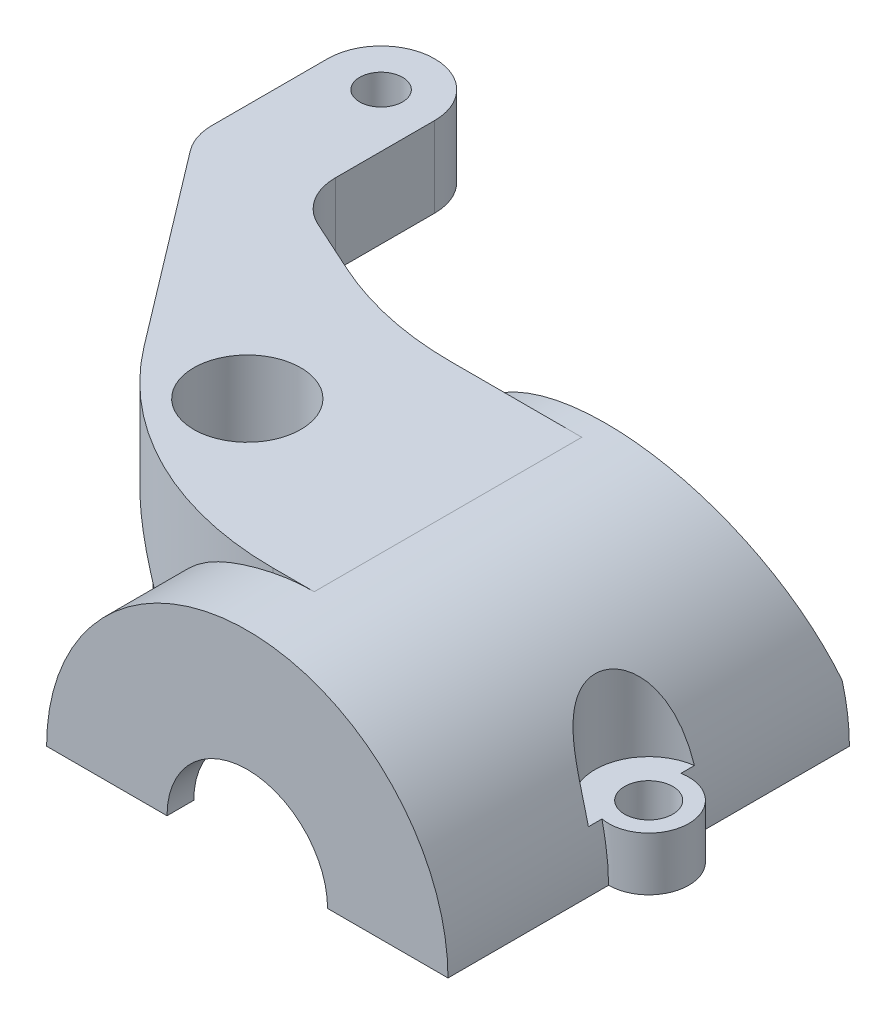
ISO-10303-21;
HEADER;
FILE_DESCRIPTION(('STEP AP214'),'2;1');
FILE_NAME('part.step','',(''),(''),'','','');
FILE_SCHEMA(('AUTOMOTIVE_DESIGN { 1 0 10303 214 1 1 1 1 }'));
ENDSEC;
DATA;
#1=APPLICATION_CONTEXT('core data for automotive mechanical design processes');
#2=APPLICATION_PROTOCOL_DEFINITION('international standard','automotive_design',2000,#1);
#3=PRODUCT_CONTEXT('',#1,'mechanical');
#4=PRODUCT('Part','Part','',(#3));
#5=PRODUCT_RELATED_PRODUCT_CATEGORY('part','',(#4));
#6=PRODUCT_DEFINITION_FORMATION('','',#4);
#7=PRODUCT_DEFINITION_CONTEXT('part definition',#1,'design');
#8=PRODUCT_DEFINITION('design','',#6,#7);
#9=PRODUCT_DEFINITION_SHAPE('','',#8);
#10=(LENGTH_UNIT() NAMED_UNIT(*) SI_UNIT(.MILLI.,.METRE.));
#11=(NAMED_UNIT(*) PLANE_ANGLE_UNIT() SI_UNIT($,.RADIAN.));
#12=(NAMED_UNIT(*) SI_UNIT($,.STERADIAN.) SOLID_ANGLE_UNIT());
#13=UNCERTAINTY_MEASURE_WITH_UNIT(LENGTH_MEASURE(1.E-05),#10,'distance_accuracy_value','');
#14=(GEOMETRIC_REPRESENTATION_CONTEXT(3) GLOBAL_UNCERTAINTY_ASSIGNED_CONTEXT((#13)) GLOBAL_UNIT_ASSIGNED_CONTEXT((#10,
#11,#12)) REPRESENTATION_CONTEXT('',''));
#15=CARTESIAN_POINT('',(0.,0.,0.));
#16=DIRECTION('',(0.,0.,1.));
#17=DIRECTION('',(1.,0.,0.));
#18=AXIS2_PLACEMENT_3D('',#15,#16,#17);
#19=CARTESIAN_POINT('',(0.,0.,31.75));
#20=DIRECTION('',(0.,0.,-1.));
#21=DIRECTION('',(-1.,0.,0.));
#22=AXIS2_PLACEMENT_3D('',#19,#20,#21);
#23=CYLINDRICAL_SURFACE('',#22,9.525);
#24=DIRECTION('',(0.,0.,-1.));
#25=VECTOR('',#24,1.);
#26=CARTESIAN_POINT('',(9.18008850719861,2.54,31.75));
#27=LINE('',#26,#25);
#28=CARTESIAN_POINT('',(9.18008850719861,2.54,24.7414729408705));
#29=VERTEX_POINT('',#28);
#30=CARTESIAN_POINT('',(9.18008850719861,2.54,24.0985156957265));
#31=VERTEX_POINT('',#30);
#32=EDGE_CURVE('E225',#29,#31,#27,.T.);
#33=ORIENTED_EDGE('',*,*,#32,.F.);
#34=CARTESIAN_POINT('',(9.18008850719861,2.54,19.7085270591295));
#35=CARTESIAN_POINT('',(9.15165298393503,2.64277811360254,19.7124339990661));
#36=CARTESIAN_POINT('',(9.12149371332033,2.74505759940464,19.7170496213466));
#37=CARTESIAN_POINT('',(9.05778237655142,2.94848443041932,19.7281287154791));
#38=CARTESIAN_POINT('',(9.02422933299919,3.04963144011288,19.7345927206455));
#39=CARTESIAN_POINT('',(8.95357903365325,3.25123411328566,19.7498453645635));
#40=CARTESIAN_POINT('',(8.91646071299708,3.35168136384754,19.7586484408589));
#41=CARTESIAN_POINT('',(8.8389757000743,3.55099766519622,19.7790705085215));
#42=CARTESIAN_POINT('',(8.79860930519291,3.64986685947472,19.7906892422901));
#43=CARTESIAN_POINT('',(8.6714264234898,3.94699551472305,19.8310371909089));
#44=CARTESIAN_POINT('',(8.57965592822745,4.14255234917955,19.8650518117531));
#45=CARTESIAN_POINT('',(8.43387413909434,4.42795923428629,19.930691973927));
#46=CARTESIAN_POINT('',(8.38399242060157,4.52166269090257,19.9549694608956));
#47=CARTESIAN_POINT('',(8.28188125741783,4.70607563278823,20.009237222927));
#48=CARTESIAN_POINT('',(8.22965280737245,4.79678635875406,20.0392250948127));
#49=CARTESIAN_POINT('',(8.13792738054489,4.95029610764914,20.096690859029));
#50=CARTESIAN_POINT('',(8.09885946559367,5.01393770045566,20.1226082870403));
#51=CARTESIAN_POINT('',(8.02002885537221,5.13908841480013,20.1782973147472));
#52=CARTESIAN_POINT('',(7.98026609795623,5.20059734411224,20.2080692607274));
#53=CARTESIAN_POINT('',(7.90047261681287,5.3210298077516,20.271769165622));
#54=CARTESIAN_POINT('',(7.86044268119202,5.37995876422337,20.3056877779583));
#55=CARTESIAN_POINT('',(7.78046614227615,5.49498818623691,20.3780810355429));
#56=CARTESIAN_POINT('',(7.74051953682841,5.55108872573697,20.4165555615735));
#57=CARTESIAN_POINT('',(7.62049784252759,5.71595608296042,20.540416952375));
#58=CARTESIAN_POINT('',(7.54124503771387,5.81978748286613,20.6334780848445));
#59=CARTESIAN_POINT('',(7.39084197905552,6.00963673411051,20.8417625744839));
#60=CARTESIAN_POINT('',(7.31967415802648,6.09569355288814,20.9569363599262));
#61=CARTESIAN_POINT('',(7.21323181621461,6.22088351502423,21.1683502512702));
#62=CARTESIAN_POINT('',(7.17376629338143,6.26621386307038,21.2588142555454));
#63=CARTESIAN_POINT('',(7.10452892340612,6.34460632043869,21.4484196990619));
#64=CARTESIAN_POINT('',(7.07475209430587,6.37767473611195,21.5475566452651));
#65=CARTESIAN_POINT('',(7.02704458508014,6.4302068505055,21.7527981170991));
#66=CARTESIAN_POINT('',(7.00918321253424,6.44959099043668,21.8589395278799));
#67=CARTESIAN_POINT('',(6.98717033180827,6.47343448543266,22.0742843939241));
#68=CARTESIAN_POINT('',(6.98301345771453,6.47789968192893,22.1834866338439));
#69=CARTESIAN_POINT('',(6.98850314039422,6.47197396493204,22.3910233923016));
#70=CARTESIAN_POINT('',(6.99691530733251,6.46291165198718,22.4894336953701));
#71=CARTESIAN_POINT('',(7.02468248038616,6.43271921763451,22.6827651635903));
#72=CARTESIAN_POINT('',(7.04403675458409,6.41158990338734,22.7776865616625));
#73=CARTESIAN_POINT('',(7.09245734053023,6.35798466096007,22.9622204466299));
#74=CARTESIAN_POINT('',(7.12157704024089,6.32544631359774,23.0518004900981));
#75=CARTESIAN_POINT('',(7.18766241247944,6.25025113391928,23.2234637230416));
#76=CARTESIAN_POINT('',(7.22463148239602,6.20758991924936,23.3055436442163));
#77=CARTESIAN_POINT('',(7.32051895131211,6.09451088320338,23.4926388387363));
#78=CARTESIAN_POINT('',(7.38228820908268,6.01982780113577,23.5936184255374));
#79=CARTESIAN_POINT('',(7.51243719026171,5.85660496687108,23.7787253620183));
#80=CARTESIAN_POINT('',(7.58082906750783,5.76803954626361,23.8628208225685));
#81=CARTESIAN_POINT('',(7.70075442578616,5.60635005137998,23.9939758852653));
#82=CARTESIAN_POINT('',(7.75168531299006,5.53578376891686,24.0448305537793));
#83=CARTESIAN_POINT('',(7.85379372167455,5.38994385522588,24.1390247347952));
#84=CARTESIAN_POINT('',(7.90497134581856,5.3146680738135,24.1823607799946));
#85=CARTESIAN_POINT('',(8.05764274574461,5.08272895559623,24.3023272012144));
#86=CARTESIAN_POINT('',(8.15815358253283,4.92011532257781,24.3687913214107));
#87=CARTESIAN_POINT('',(8.33566413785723,4.61180113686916,24.4712750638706));
#88=CARTESIAN_POINT('',(8.41380309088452,4.46775110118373,24.5105117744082));
#89=CARTESIAN_POINT('',(8.56353854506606,4.1735665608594,24.5774282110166));
#90=CARTESIAN_POINT('',(8.63512992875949,4.02342742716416,24.6050989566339));
#91=CARTESIAN_POINT('',(8.77079512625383,3.7184246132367,24.6515025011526));
#92=CARTESIAN_POINT('',(8.83486547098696,3.5635587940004,24.6702311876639));
#93=CARTESIAN_POINT('',(8.95489857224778,3.25016231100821,24.7009683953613));
#94=CARTESIAN_POINT('',(9.01086526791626,3.0916334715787,24.7129801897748));
#95=CARTESIAN_POINT('',(9.08361476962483,2.86674456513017,24.7264457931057));
#96=CARTESIAN_POINT('',(9.10391319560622,2.80161510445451,24.7299311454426));
#97=CARTESIAN_POINT('',(9.14306832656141,2.67105932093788,24.7361989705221));
#98=CARTESIAN_POINT('',(9.16192833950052,2.60563406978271,24.7389830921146));
#99=CARTESIAN_POINT('',(9.18008850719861,2.54,24.7414729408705));
#100=B_SPLINE_CURVE_WITH_KNOTS('',3,(#34,#35,#36,#37,#38,#39,#40,#41,#42,#43,#44,#45,#46,#47,
#48,#49,#50,#51,#52,#53,#54,#55,#56,#57,#58,#59,#60,#61,#62,#63,#64,#65,#66,#67,#68,#69,#70,#71,
#72,#73,#74,#75,#76,#77,#78,#79,#80,#81,#82,#83,#84,#85,#86,#87,#88,#89,#90,#91,#92,#93,#94,#95,
#96,#97,#98,#99),.UNSPECIFIED.,.F.,.F.,(4,2,2,2,2,2,2,2,2,2,2,2,2,2,2,2,2,2,2,2,2,2,2,2,2,2,2,2,
2,2,2,2,4),(0.,0.320121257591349,0.640334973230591,0.962573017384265,1.28478159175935,
1.93943341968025,2.26595435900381,2.59233818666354,2.82936720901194,3.06641754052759,
3.30294308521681,3.53946244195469,4.01832959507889,4.49613550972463,4.8206857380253,
5.14506881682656,5.47132262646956,5.79744867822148,6.09357968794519,6.3896908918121,
6.68744807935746,6.98533440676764,7.4029105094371,7.8212680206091,8.12325043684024,
8.42537174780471,9.03031795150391,9.53521764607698,10.0405086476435,10.5460318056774,
11.0513084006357,11.2562187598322,11.460642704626),.UNSPECIFIED.);
#101=CARTESIAN_POINT('',(9.18008850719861,2.54,19.7085270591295));
#102=VERTEX_POINT('',#101);
#103=EDGE_CURVE('E11',#102,#29,#100,.T.);
#104=ORIENTED_EDGE('',*,*,#103,.F.);
#105=CARTESIAN_POINT('',(9.18008850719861,2.54,20.3514843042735));
#106=VERTEX_POINT('',#105);
#107=EDGE_CURVE('E214',#106,#102,#27,.T.);
#108=ORIENTED_EDGE('',*,*,#107,.F.);
#109=CARTESIAN_POINT('',(9.18008850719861,2.54,20.3514843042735));
#110=CARTESIAN_POINT('',(9.20869884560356,2.43660196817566,20.3462304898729));
#111=CARTESIAN_POINT('',(9.23557027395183,2.33268053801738,20.3419478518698));
#112=CARTESIAN_POINT('',(9.28579447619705,2.12394910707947,20.3349042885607));
#113=CARTESIAN_POINT('',(9.30914758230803,2.01913919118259,20.3321432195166));
#114=CARTESIAN_POINT('',(9.35219932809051,1.80925887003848,20.3277316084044));
#115=CARTESIAN_POINT('',(9.37191446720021,1.70419194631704,20.3260759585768));
#116=CARTESIAN_POINT('',(9.40779882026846,1.49344293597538,20.3235233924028));
#117=CARTESIAN_POINT('',(9.4239679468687,1.38776083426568,20.3226264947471));
#118=CARTESIAN_POINT('',(9.45273917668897,1.17591390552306,20.3213165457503));
#119=CARTESIAN_POINT('',(9.46534142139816,1.06974909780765,20.3209034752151));
#120=CARTESIAN_POINT('',(9.4869651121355,0.857055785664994,20.3203492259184));
#121=CARTESIAN_POINT('',(9.49598658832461,0.75052728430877,20.3202080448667));
#122=CARTESIAN_POINT('',(9.5104721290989,0.536728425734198,20.3200407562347));
#123=CARTESIAN_POINT('',(9.51591937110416,0.429456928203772,20.3200151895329));
#124=CARTESIAN_POINT('',(9.52318369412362,0.214790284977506,20.3200003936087));
#125=CARTESIAN_POINT('',(9.52500074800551,0.107395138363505,20.3200111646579));
#126=CARTESIAN_POINT('',(9.525,0.,20.32));
#127=B_SPLINE_CURVE_WITH_KNOTS('',3,(#109,#110,#111,#112,#113,#114,#115,#116,#117,#118,#119,
#120,#121,#122,#123,#124,#125,#126),.UNSPECIFIED.,.F.,.F.,(4,2,2,2,2,2,2,2,4),(0.,
0.322206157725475,0.644381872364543,0.965058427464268,1.28574288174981,1.60641461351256,
1.92708364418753,2.24925131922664,2.57142140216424),.UNSPECIFIED.);
#128=CARTESIAN_POINT('',(9.525,0.,20.32));
#129=VERTEX_POINT('',#128);
#130=EDGE_CURVE('E43',#106,#129,#127,.T.);
#131=ORIENTED_EDGE('',*,*,#130,.T.);
#132=DIRECTION('',(0.,0.,1.));
#133=VECTOR('',#132,1.);
#134=CARTESIAN_POINT('',(9.525,0.,32.7805207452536));
#135=LINE('',#134,#133);
#136=CARTESIAN_POINT('',(9.525,0.,12.7));
#137=VERTEX_POINT('',#136);
#138=EDGE_CURVE('E522',#137,#129,#135,.T.);
#139=ORIENTED_EDGE('',*,*,#138,.F.);
#140=CARTESIAN_POINT('',(0.,0.,12.7));
#141=DIRECTION('',(0.,0.,1.));
#142=DIRECTION('',(1.,0.,0.));
#143=AXIS2_PLACEMENT_3D('',#140,#141,#142);
#144=CIRCLE('',#143,9.525);
#145=CARTESIAN_POINT('',(9.18008850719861,2.54,12.7));
#146=VERTEX_POINT('',#145);
#147=EDGE_CURVE('E369',#137,#146,#144,.T.);
#148=ORIENTED_EDGE('',*,*,#147,.T.);
#149=CARTESIAN_POINT('',(0.,0.,11.9610909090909));
#150=DIRECTION('',(0.,-0.279329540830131,0.960195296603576));
#151=DIRECTION('',(0.,-0.960195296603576,-0.279329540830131));
#152=AXIS2_PLACEMENT_3D('',#149,#150,#151);
#153=ELLIPSE('',#152,9.91985696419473,9.525);
#154=CARTESIAN_POINT('',(-9.18008850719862,2.54,12.7));
#155=VERTEX_POINT('',#154);
#156=EDGE_CURVE('E371',#146,#155,#153,.T.);
#157=ORIENTED_EDGE('',*,*,#156,.T.);
#158=CARTESIAN_POINT('',(0.,0.,12.7));
#159=DIRECTION('',(0.,0.,1.));
#160=DIRECTION('',(1.,0.,0.));
#161=AXIS2_PLACEMENT_3D('',#158,#159,#160);
#162=CIRCLE('',#161,9.525);
#163=CARTESIAN_POINT('',(-9.525,0.,12.7));
#164=VERTEX_POINT('',#163);
#165=EDGE_CURVE('E358',#155,#164,#162,.T.);
#166=ORIENTED_EDGE('',*,*,#165,.T.);
#167=DIRECTION('',(0.,0.,1.));
#168=VECTOR('',#167,1.);
#169=CARTESIAN_POINT('',(-9.525,0.,32.7805207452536));
#170=LINE('',#169,#168);
#171=CARTESIAN_POINT('',(-9.525,0.,19.05));
#172=VERTEX_POINT('',#171);
#173=EDGE_CURVE('E525',#164,#172,#170,.T.);
#174=ORIENTED_EDGE('',*,*,#173,.T.);
#175=CARTESIAN_POINT('',(-9.525,0.,19.05));
#176=CARTESIAN_POINT('',(-9.52500157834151,0.133111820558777,19.0500154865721));
#177=CARTESIAN_POINT('',(-9.5222096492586,0.266222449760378,19.0500004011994));
#178=CARTESIAN_POINT('',(-9.51105081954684,0.532210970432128,19.0500216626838));
#179=CARTESIAN_POINT('',(-9.50268387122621,0.665088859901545,19.0500580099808));
#180=CARTESIAN_POINT('',(-9.48037739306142,0.930494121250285,19.0502948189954));
#181=CARTESIAN_POINT('',(-9.46643304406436,1.0630210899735,19.0504954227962));
#182=CARTESIAN_POINT('',(-9.43299984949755,1.32736304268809,19.0512899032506));
#183=CARTESIAN_POINT('',(-9.41351104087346,1.45917803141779,19.0518837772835));
#184=CARTESIAN_POINT('',(-9.34637698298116,1.85555373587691,19.0547024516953));
#185=CARTESIAN_POINT('',(-9.29025858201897,2.11872446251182,19.0579718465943));
#186=CARTESIAN_POINT('',(-9.15603049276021,2.63910271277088,19.0707914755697));
#187=CARTESIAN_POINT('',(-9.07793434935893,2.8963138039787,19.0803378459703));
#188=CARTESIAN_POINT('',(-8.93230553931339,3.31198269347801,19.1052811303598));
#189=CARTESIAN_POINT('',(-8.87099561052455,3.4728377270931,19.1173613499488));
#190=CARTESIAN_POINT('',(-8.7399739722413,3.79051207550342,19.1478434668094));
#191=CARTESIAN_POINT('',(-8.67026223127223,3.94733137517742,19.1662453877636));
#192=CARTESIAN_POINT('',(-8.52323225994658,4.25548811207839,19.2112026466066));
#193=CARTESIAN_POINT('',(-8.4459420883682,4.4068431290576,19.2377286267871));
#194=CARTESIAN_POINT('',(-8.2843740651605,4.70353674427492,19.3011321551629));
#195=CARTESIAN_POINT('',(-8.20009904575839,4.8488777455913,19.3380055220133));
#196=CARTESIAN_POINT('',(-8.05422094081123,5.08603490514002,19.4104434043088));
#197=CARTESIAN_POINT('',(-7.99416791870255,5.17987343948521,19.4425266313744));
#198=CARTESIAN_POINT('',(-7.87204104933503,5.36365125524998,19.5132969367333));
#199=CARTESIAN_POINT('',(-7.80996777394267,5.45359162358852,19.5519821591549));
#200=CARTESIAN_POINT('',(-7.68455698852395,5.62892624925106,19.6367351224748));
#201=CARTESIAN_POINT('',(-7.62122041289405,5.71432370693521,19.6827975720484));
#202=CARTESIAN_POINT('',(-7.49421832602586,5.87989949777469,19.7830547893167));
#203=CARTESIAN_POINT('',(-7.43055291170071,5.96007928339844,19.837247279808));
#204=CARTESIAN_POINT('',(-7.2708319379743,6.15497114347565,19.9852173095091));
#205=CARTESIAN_POINT('',(-7.17527975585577,6.2657701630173,20.0848600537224));
#206=CARTESIAN_POINT('',(-6.99145355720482,6.47024833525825,20.306050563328));
#207=CARTESIAN_POINT('',(-6.90317141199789,6.56394675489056,20.4275733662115));
#208=CARTESIAN_POINT('',(-6.7534725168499,6.71757840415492,20.670585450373));
#209=CARTESIAN_POINT('',(-6.69001985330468,6.78052137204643,20.7889046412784));
#210=CARTESIAN_POINT('',(-6.57671888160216,6.8904750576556,21.0388083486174));
#211=CARTESIAN_POINT('',(-6.52686648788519,6.93749056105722,21.1703888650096));
#212=CARTESIAN_POINT('',(-6.4441375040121,7.01441095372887,21.4443160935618));
#213=CARTESIAN_POINT('',(-6.41134201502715,7.04423416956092,21.5867106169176));
#214=CARTESIAN_POINT('',(-6.36568009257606,7.08552895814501,21.8772628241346));
#215=CARTESIAN_POINT('',(-6.35280831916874,7.09700544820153,22.0254189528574));
#216=CARTESIAN_POINT('',(-6.34822170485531,7.10110501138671,22.3095251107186));
#217=CARTESIAN_POINT('',(-6.35478401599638,7.0952633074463,22.4454301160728));
#218=CARTESIAN_POINT('',(-6.38493888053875,7.06813884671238,22.7137263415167));
#219=CARTESIAN_POINT('',(-6.40852774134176,7.04685943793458,22.8461183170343));
#220=CARTESIAN_POINT('',(-6.47081644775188,6.98969975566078,23.1023837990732));
#221=CARTESIAN_POINT('',(-6.50935154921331,6.95397849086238,23.2263334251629));
#222=CARTESIAN_POINT('',(-6.59915843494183,6.8688094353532,23.4644691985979));
#223=CARTESIAN_POINT('',(-6.65043214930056,6.81935956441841,23.5786538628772));
#224=CARTESIAN_POINT('',(-6.766959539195,6.70381057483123,23.8032916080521));
#225=CARTESIAN_POINT('',(-6.83296124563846,6.63675851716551,23.9128614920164));
#226=CARTESIAN_POINT('',(-6.97266888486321,6.48982049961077,24.1175134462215));
#227=CARTESIAN_POINT('',(-7.04637911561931,6.40992736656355,24.2125873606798));
#228=CARTESIAN_POINT('',(-7.17857002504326,6.26106949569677,24.3656400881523));
#229=CARTESIAN_POINT('',(-7.23610756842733,6.19455791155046,24.4268786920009));
#230=CARTESIAN_POINT('',(-7.35236880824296,6.05610970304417,24.541672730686));
#231=CARTESIAN_POINT('',(-7.41109295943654,5.98417096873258,24.595225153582));
#232=CARTESIAN_POINT('',(-7.52875652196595,5.83544820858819,24.6951428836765));
#233=CARTESIAN_POINT('',(-7.58769612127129,5.75865737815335,24.7414977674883));
#234=CARTESIAN_POINT('',(-7.70488425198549,5.60089743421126,24.8275155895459));
#235=CARTESIAN_POINT('',(-7.76313254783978,5.51992694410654,24.8671763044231));
#236=CARTESIAN_POINT('',(-7.90672536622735,5.31337884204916,24.9585362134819));
#237=CARTESIAN_POINT('',(-7.991222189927,5.18554659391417,25.0064872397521));
#238=CARTESIAN_POINT('',(-8.15546342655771,4.92321414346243,25.0909250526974));
#239=CARTESIAN_POINT('',(-8.2352053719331,4.78871054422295,25.127405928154));
#240=CARTESIAN_POINT('',(-8.38895716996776,4.51396218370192,25.1909680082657));
#241=CARTESIAN_POINT('',(-8.46295466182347,4.37370598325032,25.2180293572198));
#242=CARTESIAN_POINT('',(-8.6043026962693,4.08863567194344,25.2644851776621));
#243=CARTESIAN_POINT('',(-8.6716511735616,3.94382016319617,25.2838772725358));
#244=CARTESIAN_POINT('',(-8.83310784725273,3.57236984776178,25.3253421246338));
#245=CARTESIAN_POINT('',(-8.92240159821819,3.34317634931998,25.3433568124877));
#246=CARTESIAN_POINT('',(-9.08312955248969,2.87802514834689,25.3701553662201));
#247=CARTESIAN_POINT('',(-9.15455308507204,2.64206349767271,25.3789337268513));
#248=CARTESIAN_POINT('',(-9.27886830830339,2.1653761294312,25.3910608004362));
#249=CARTESIAN_POINT('',(-9.33177360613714,1.92465404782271,25.3944135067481));
#250=CARTESIAN_POINT('',(-9.41874639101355,1.43994100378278,25.3985204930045));
#251=CARTESIAN_POINT('',(-9.45282453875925,1.19595197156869,25.3992762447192));
#252=CARTESIAN_POINT('',(-9.49327338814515,0.792882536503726,25.3998801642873));
#253=CARTESIAN_POINT('',(-9.50518268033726,0.63433722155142,25.3999549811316));
#254=CARTESIAN_POINT('',(-9.52103814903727,0.317198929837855,25.4000005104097));
#255=CARTESIAN_POINT('',(-9.52500180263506,0.15860682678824,25.3999714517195));
#256=CARTESIAN_POINT('',(-9.525,0.,25.4));
#257=B_SPLINE_CURVE_WITH_KNOTS('',3,(#175,#176,#177,#178,#179,#180,#181,#182,#183,#184,#185,
#186,#187,#188,#189,#190,#191,#192,#193,#194,#195,#196,#197,#198,#199,#200,#201,#202,#203,#204,
#205,#206,#207,#208,#209,#210,#211,#212,#213,#214,#215,#216,#217,#218,#219,#220,#221,#222,#223,
#224,#225,#226,#227,#228,#229,#230,#231,#232,#233,#234,#235,#236,#237,#238,#239,#240,#241,#242,
#243,#244,#245,#246,#247,#248,#249,#250,#251,#252,#253,#254,#255,#256),.UNSPECIFIED.,.F.,.F.,(4,
2,2,2,2,2,2,2,2,2,2,2,2,2,2,2,2,2,2,2,2,2,2,2,2,2,2,2,2,2,2,2,2,2,2,2,2,2,2,2,4),(0.,
0.3993038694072,0.798611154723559,1.19826420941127,1.59791460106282,2.40417942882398,
3.20994843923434,3.72733480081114,4.24472310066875,4.76026335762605,5.2755955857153,
5.62317407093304,5.97065500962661,6.31788782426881,6.66502356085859,7.19400601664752,
7.72238874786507,8.16535800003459,8.60819403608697,9.0531168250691,9.4979203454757,
9.90450477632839,10.311001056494,10.7131385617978,11.1153370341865,11.5469413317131,
11.978787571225,12.2998661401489,12.6210701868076,12.9427351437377,13.2645067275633,
13.7454292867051,14.2265992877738,14.7087775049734,15.1911050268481,15.9299166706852,
16.6691684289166,17.4078758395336,18.1461645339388,18.6229561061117,19.0986977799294),.UNSPECIFIED.);
#258=CARTESIAN_POINT('',(-8.98025612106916,3.175,19.0970807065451));
#259=VERTEX_POINT('',#258);
#260=EDGE_CURVE('E247',#172,#259,#257,.T.);
#261=ORIENTED_EDGE('',*,*,#260,.T.);
#262=DIRECTION('',(0.,0.,1.));
#263=VECTOR('',#262,1.);
#264=CARTESIAN_POINT('',(-8.98025612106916,3.175,3.81));
#265=LINE('',#264,#263);
#266=CARTESIAN_POINT('',(-8.98025612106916,3.175,15.6236613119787));
#267=VERTEX_POINT('',#266);
#268=EDGE_CURVE('E248',#267,#259,#265,.T.);
#269=ORIENTED_EDGE('',*,*,#268,.F.);
#270=CARTESIAN_POINT('',(-8.98025612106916,3.175,15.6236613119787));
#271=CARTESIAN_POINT('',(-8.89086967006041,3.42789002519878,15.6400694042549));
#272=CARTESIAN_POINT('',(-8.79078832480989,3.67690939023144,15.6576773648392));
#273=CARTESIAN_POINT('',(-8.56998485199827,4.16567020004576,15.6937557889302));
#274=CARTESIAN_POINT('',(-8.4492551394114,4.40540819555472,15.7122265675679));
#275=CARTESIAN_POINT('',(-8.19079059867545,4.86882547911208,15.7480878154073));
#276=CARTESIAN_POINT('',(-8.05347903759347,5.09273968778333,15.7654929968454));
#277=CARTESIAN_POINT('',(-7.76082623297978,5.52847722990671,15.7980164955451));
#278=CARTESIAN_POINT('',(-7.60549282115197,5.74030575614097,15.8131357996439));
#279=CARTESIAN_POINT('',(-7.25990950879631,6.17284294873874,15.8408349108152));
#280=CARTESIAN_POINT('',(-7.06769997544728,6.39202689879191,15.8529620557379));
#281=CARTESIAN_POINT('',(-6.76365459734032,6.70823106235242,15.8657815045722));
#282=CARTESIAN_POINT('',(-6.65899530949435,6.81213283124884,15.8691632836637));
#283=CARTESIAN_POINT('',(-6.44493658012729,7.0149951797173,15.87377270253));
#284=CARTESIAN_POINT('',(-6.33553685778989,7.11395546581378,15.8750002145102));
#285=CARTESIAN_POINT('',(-6.22387587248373,7.21033939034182,15.875));
#286=B_SPLINE_CURVE_WITH_KNOTS('',3,(#270,#271,#272,#273,#274,#275,#276,#277,#278,#279,#280,
#281,#282,#283,#284,#285),.UNSPECIFIED.,.F.,.F.,(4,2,2,2,2,2,2,4),(0.,0.805915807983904,
1.61212830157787,2.40094007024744,3.18941032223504,4.06331284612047,4.5057061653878,
4.94812572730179),.UNSPECIFIED.);
#287=CARTESIAN_POINT('',(-6.22387587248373,7.21033939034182,15.875));
#288=VERTEX_POINT('',#287);
#289=EDGE_CURVE('E398',#267,#288,#286,.T.);
#290=ORIENTED_EDGE('',*,*,#289,.T.);
#291=CARTESIAN_POINT('',(0.,0.,15.875));
#292=DIRECTION('',(0.,0.,1.));
#293=DIRECTION('',(1.,0.,0.));
#294=AXIS2_PLACEMENT_3D('',#291,#292,#293);
#295=CIRCLE('',#294,9.525);
#296=CARTESIAN_POINT('',(0.,9.525,15.875));
#297=VERTEX_POINT('',#296);
#298=EDGE_CURVE('E476',#297,#288,#295,.T.);
#299=ORIENTED_EDGE('',*,*,#298,.F.);
#300=DIRECTION('',(0.,0.,1.));
#301=VECTOR('',#300,1.);
#302=CARTESIAN_POINT('',(0.,9.525,3.81));
#303=LINE('',#302,#301);
#304=CARTESIAN_POINT('',(0.,9.525,28.575));
#305=VERTEX_POINT('',#304);
#306=EDGE_CURVE('E444',#297,#305,#303,.T.);
#307=ORIENTED_EDGE('',*,*,#306,.T.);
#308=CARTESIAN_POINT('',(0.,0.,28.575));
#309=DIRECTION('',(0.,0.,-1.));
#310=DIRECTION('',(-1.,0.,0.));
#311=AXIS2_PLACEMENT_3D('',#308,#309,#310);
#312=CIRCLE('',#311,9.525);
#313=CARTESIAN_POINT('',(-1.96557172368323,9.3199867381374,28.575));
#314=VERTEX_POINT('',#313);
#315=EDGE_CURVE('E518',#314,#305,#312,.T.);
#316=ORIENTED_EDGE('',*,*,#315,.F.);
#317=CARTESIAN_POINT('',(-1.96557172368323,9.31998673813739,28.575));
#318=CARTESIAN_POINT('',(-2.08867963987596,9.29402449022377,28.5750016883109));
#319=CARTESIAN_POINT('',(-2.21125362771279,9.26562455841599,28.5735078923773));
#320=CARTESIAN_POINT('',(-2.45510667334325,9.20401489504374,28.5676236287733));
#321=CARTESIAN_POINT('',(-2.57638583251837,9.17080554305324,28.5632333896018));
#322=CARTESIAN_POINT('',(-2.93774677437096,9.06412073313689,28.5458697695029));
#323=CARTESIAN_POINT('',(-3.17558033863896,8.98354029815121,28.5287031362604));
#324=CARTESIAN_POINT('',(-3.64184661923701,8.8048039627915,28.484331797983));
#325=CARTESIAN_POINT('',(-3.87032773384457,8.70675799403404,28.4571888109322));
#326=CARTESIAN_POINT('',(-4.31797332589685,8.49365554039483,28.3940472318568));
#327=CARTESIAN_POINT('',(-4.5371364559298,8.37859660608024,28.358047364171));
#328=CARTESIAN_POINT('',(-4.96421419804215,8.13281872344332,28.278654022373));
#329=CARTESIAN_POINT('',(-5.17215920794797,8.00214553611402,28.2352820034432));
#330=CARTESIAN_POINT('',(-5.57652761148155,7.72579875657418,28.1424863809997));
#331=CARTESIAN_POINT('',(-5.77294578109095,7.5801184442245,28.0930600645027));
#332=CARTESIAN_POINT('',(-6.15367589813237,7.2744497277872,27.9895686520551));
#333=CARTESIAN_POINT('',(-6.33796268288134,7.11443311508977,27.9354944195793));
#334=CARTESIAN_POINT('',(-6.69326192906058,6.78123833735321,27.8243478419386));
#335=CARTESIAN_POINT('',(-6.86427343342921,6.60805922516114,27.7672752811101));
#336=CARTESIAN_POINT('',(-7.20604955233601,6.23440638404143,27.6469006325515));
#337=CARTESIAN_POINT('',(-7.37560102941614,6.03286101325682,27.5834763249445));
#338=CARTESIAN_POINT('',(-7.6975374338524,5.61630191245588,27.4570426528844));
#339=CARTESIAN_POINT('',(-7.84991864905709,5.40128528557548,27.3940333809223));
#340=CARTESIAN_POINT('',(-8.13630434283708,4.95936984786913,27.2707064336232));
#341=CARTESIAN_POINT('',(-8.27035105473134,4.73250006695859,27.2103827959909));
#342=CARTESIAN_POINT('',(-8.51955084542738,4.26759405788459,27.0944273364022));
#343=CARTESIAN_POINT('',(-8.63471607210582,4.02956513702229,27.0387925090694));
#344=CARTESIAN_POINT('',(-8.7834574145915,3.68625405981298,26.9649812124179));
#345=CARTESIAN_POINT('',(-8.8252432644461,3.58506887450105,26.943987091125));
#346=CARTESIAN_POINT('',(-8.90534989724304,3.38117589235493,26.9033120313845));
#347=CARTESIAN_POINT('',(-8.94367350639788,3.27846941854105,26.8836300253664));
#348=CARTESIAN_POINT('',(-8.98025612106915,3.175,26.8646638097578));
#349=B_SPLINE_CURVE_WITH_KNOTS('',3,(#317,#318,#319,#320,#321,#322,#323,#324,#325,#326,#327,
#328,#329,#330,#331,#332,#333,#334,#335,#336,#337,#338,#339,#340,#341,#342,#343,#344,#345,#346,
#347,#348),.UNSPECIFIED.,.F.,.F.,(4,2,2,2,2,2,2,2,2,2,2,2,2,2,2,4),(0.,0.377376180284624,
0.754722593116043,1.5087179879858,2.25812527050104,3.00764055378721,3.75501074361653,
4.50271707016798,5.25192835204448,6.00119359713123,6.81302735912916,7.62503630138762,
8.43514210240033,9.24472463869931,9.57907155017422,9.91314302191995),.UNSPECIFIED.);
#350=CARTESIAN_POINT('',(-8.98025612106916,3.175,26.8646638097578));
#351=VERTEX_POINT('',#350);
#352=EDGE_CURVE('E450',#314,#351,#349,.T.);
#353=ORIENTED_EDGE('',*,*,#352,.T.);
#354=CARTESIAN_POINT('',(-8.98025612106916,3.175,25.3529192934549));
#355=VERTEX_POINT('',#354);
#356=EDGE_CURVE('E534',#355,#351,#265,.T.);
#357=ORIENTED_EDGE('',*,*,#356,.F.);
#358=CARTESIAN_POINT('',(-9.525,0.,25.4));
#359=VERTEX_POINT('',#358);
#360=EDGE_CURVE('E59',#355,#359,#257,.T.);
#361=ORIENTED_EDGE('',*,*,#360,.T.);
#362=CARTESIAN_POINT('',(-9.525,0.,31.75));
#363=VERTEX_POINT('',#362);
#364=EDGE_CURVE('E524',#359,#363,#170,.T.);
#365=ORIENTED_EDGE('',*,*,#364,.T.);
#366=CARTESIAN_POINT('',(0.,0.,31.75));
#367=DIRECTION('',(0.,0.,1.));
#368=DIRECTION('',(1.,0.,0.));
#369=AXIS2_PLACEMENT_3D('',#366,#367,#368);
#370=CIRCLE('',#369,9.525);
#371=CARTESIAN_POINT('',(9.525,0.,31.75));
#372=VERTEX_POINT('',#371);
#373=EDGE_CURVE('E354',#372,#363,#370,.T.);
#374=ORIENTED_EDGE('',*,*,#373,.F.);
#375=CARTESIAN_POINT('',(9.525,0.,24.13));
#376=VERTEX_POINT('',#375);
#377=EDGE_CURVE('E521',#376,#372,#135,.T.);
#378=ORIENTED_EDGE('',*,*,#377,.F.);
#379=CARTESIAN_POINT('',(9.525,0.,24.13));
#380=CARTESIAN_POINT('',(9.52500074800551,0.107395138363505,24.1299888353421));
#381=CARTESIAN_POINT('',(9.52318369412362,0.214790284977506,24.1299996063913));
#382=CARTESIAN_POINT('',(9.51591937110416,0.429456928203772,24.1299848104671));
#383=CARTESIAN_POINT('',(9.5104721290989,0.536728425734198,24.1299592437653));
#384=CARTESIAN_POINT('',(9.49598658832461,0.75052728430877,24.1297919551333));
#385=CARTESIAN_POINT('',(9.4869651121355,0.857055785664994,24.1296507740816));
#386=CARTESIAN_POINT('',(9.46534142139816,1.06974909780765,24.1290965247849));
#387=CARTESIAN_POINT('',(9.45273917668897,1.17591390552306,24.1286834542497));
#388=CARTESIAN_POINT('',(9.4239679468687,1.38776083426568,24.1273735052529));
#389=CARTESIAN_POINT('',(9.40779882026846,1.49344293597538,24.1264766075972));
#390=CARTESIAN_POINT('',(9.37191446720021,1.70419194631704,24.1239240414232));
#391=CARTESIAN_POINT('',(9.35219932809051,1.80925887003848,24.1222683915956));
#392=CARTESIAN_POINT('',(9.30914758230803,2.01913919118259,24.1178567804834));
#393=CARTESIAN_POINT('',(9.28579447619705,2.12394910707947,24.1150957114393));
#394=CARTESIAN_POINT('',(9.23557027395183,2.33268053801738,24.1080521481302));
#395=CARTESIAN_POINT('',(9.20869884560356,2.43660196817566,24.1037695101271));
#396=CARTESIAN_POINT('',(9.18008850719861,2.54,24.0985156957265));
#397=B_SPLINE_CURVE_WITH_KNOTS('',3,(#379,#380,#381,#382,#383,#384,#385,#386,#387,#388,#389,
#390,#391,#392,#393,#394,#395,#396),.UNSPECIFIED.,.F.,.F.,(4,2,2,2,2,2,2,2,4),(0.,
0.322170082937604,0.644337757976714,0.965006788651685,1.28567852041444,1.60636297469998,
1.9270395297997,2.24921524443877,2.57142140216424),.UNSPECIFIED.);
#398=EDGE_CURVE('E233',#376,#31,#397,.T.);
#399=ORIENTED_EDGE('',*,*,#398,.T.);
#400=EDGE_LOOP('',(#33,#104,#108,#131,#139,#148,#157,#166,#174,#261,#269,#290,#299,#307,#316,
#353,#357,#361,#365,#374,#378,#399));
#401=FACE_BOUND('',#400,.T.);
#402=ADVANCED_FACE('F33',(#401),#23,.T.);
#403=CARTESIAN_POINT('',(-15.021059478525,9.525,13.376791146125));
#404=DIRECTION('',(-0.413802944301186,0.,0.910366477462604));
#405=DIRECTION('',(0.910366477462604,0.,0.413802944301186));
#406=AXIS2_PLACEMENT_3D('',#403,#404,#405);
#407=PLANE('',#406);
#408=DIRECTION('',(-0.910366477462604,0.,-0.413802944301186));
#409=VECTOR('',#408,1.);
#410=CARTESIAN_POINT('',(-15.021059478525,9.525,13.376791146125));
#411=LINE('',#410,#409);
#412=CARTESIAN_POINT('',(-12.5302327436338,9.525,14.5089851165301));
#413=VERTEX_POINT('',#412);
#414=CARTESIAN_POINT('',(-15.021059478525,9.525,13.376791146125));
#415=VERTEX_POINT('',#414);
#416=EDGE_CURVE('E482',#413,#415,#411,.T.);
#417=ORIENTED_EDGE('',*,*,#416,.F.);
#418=DIRECTION('',(0.,-1.,0.));
#419=VECTOR('',#418,1.);
#420=CARTESIAN_POINT('',(-12.5302327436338,3.71974387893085,14.5089851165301));
#421=LINE('',#420,#419);
#422=CARTESIAN_POINT('',(-12.5302327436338,5.20773178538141,14.5089851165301));
#423=VERTEX_POINT('',#422);
#424=EDGE_CURVE('E396',#413,#423,#421,.T.);
#425=ORIENTED_EDGE('',*,*,#424,.T.);
#426=CARTESIAN_POINT('',(-15.7004644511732,-4.445,13.0679707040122));
#427=DIRECTION('',(-0.413802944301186,0.,0.910366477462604));
#428=DIRECTION('',(-0.910366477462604,0.,-0.413802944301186));
#429=AXIS2_PLACEMENT_3D('',#426,#427,#428);
#430=ELLIPSE('',#429,11.1603406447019,10.16);
#431=CARTESIAN_POINT('',(-15.021059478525,5.69225845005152,13.376791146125));
#432=VERTEX_POINT('',#431);
#433=EDGE_CURVE('E419',#423,#432,#430,.T.);
#434=ORIENTED_EDGE('',*,*,#433,.T.);
#435=DIRECTION('',(0.,-1.,0.));
#436=VECTOR('',#435,1.);
#437=CARTESIAN_POINT('',(-15.021059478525,9.525,13.376791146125));
#438=LINE('',#437,#436);
#439=EDGE_CURVE('E435',#415,#432,#438,.T.);
#440=ORIENTED_EDGE('',*,*,#439,.F.);
#441=EDGE_LOOP('',(#417,#425,#434,#440));
#442=FACE_BOUND('',#441,.T.);
#443=ADVANCED_FACE('F304',(#442),#407,.F.);
#444=CARTESIAN_POINT('',(-9.525,0.,32.7805207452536));
#445=DIRECTION('',(0.,1.,0.));
#446=DIRECTION('',(0.,0.,1.));
#447=AXIS2_PLACEMENT_3D('',#444,#445,#446);
#448=PLANE('',#447);
#449=CARTESIAN_POINT('',(9.525,0.,22.225));
#450=DIRECTION('',(0.,-1.,0.));
#451=DIRECTION('',(0.,0.,-1.));
#452=AXIS2_PLACEMENT_3D('',#449,#450,#451);
#453=CIRCLE('',#452,1.143);
#454=CARTESIAN_POINT('',(9.525,0.,21.082));
#455=VERTEX_POINT('',#454);
#456=EDGE_CURVE('E769',#455,#455,#453,.T.);
#457=ORIENTED_EDGE('',*,*,#456,.F.);
#458=EDGE_LOOP('',(#457));
#459=FACE_BOUND('',#458,.T.);
#460=CARTESIAN_POINT('',(-9.525,0.,22.225));
#461=DIRECTION('',(0.,-1.,0.));
#462=DIRECTION('',(0.,0.,-1.));
#463=AXIS2_PLACEMENT_3D('',#460,#461,#462);
#464=CIRCLE('',#463,1.143);
#465=CARTESIAN_POINT('',(-9.525,0.,21.082));
#466=VERTEX_POINT('',#465);
#467=EDGE_CURVE('E772',#466,#466,#464,.T.);
#468=ORIENTED_EDGE('',*,*,#467,.F.);
#469=EDGE_LOOP('',(#468));
#470=FACE_BOUND('',#469,.T.);
#471=ORIENTED_EDGE('',*,*,#138,.T.);
#472=CARTESIAN_POINT('',(9.525,0.,22.225));
#473=DIRECTION('',(0.,-1.,0.));
#474=DIRECTION('',(0.,0.,-1.));
#475=AXIS2_PLACEMENT_3D('',#472,#473,#474);
#476=CIRCLE('',#475,1.905);
#477=EDGE_CURVE('E51',#129,#376,#476,.T.);
#478=ORIENTED_EDGE('',*,*,#477,.T.);
#479=ORIENTED_EDGE('',*,*,#377,.T.);
#480=DIRECTION('',(-1.,0.,0.));
#481=VECTOR('',#480,1.);
#482=CARTESIAN_POINT('',(0.,0.,31.75));
#483=LINE('',#482,#481);
#484=CARTESIAN_POINT('',(3.81,0.,31.75));
#485=VERTEX_POINT('',#484);
#486=EDGE_CURVE('E357',#372,#485,#483,.T.);
#487=ORIENTED_EDGE('',*,*,#486,.T.);
#488=DIRECTION('',(0.,0.,1.));
#489=VECTOR('',#488,1.);
#490=CARTESIAN_POINT('',(3.81,0.,33.6611804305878));
#491=LINE('',#490,#489);
#492=CARTESIAN_POINT('',(3.81,0.,30.48));
#493=VERTEX_POINT('',#492);
#494=EDGE_CURVE('E389',#493,#485,#491,.T.);
#495=ORIENTED_EDGE('',*,*,#494,.F.);
#496=DIRECTION('',(-1.,0.,0.));
#497=VECTOR('',#496,1.);
#498=CARTESIAN_POINT('',(-9.525,0.,30.48));
#499=LINE('',#498,#497);
#500=CARTESIAN_POINT('',(7.9375,0.,30.48));
#501=VERTEX_POINT('',#500);
#502=EDGE_CURVE('E388',#501,#493,#499,.T.);
#503=ORIENTED_EDGE('',*,*,#502,.F.);
#504=DIRECTION('',(0.,0.,1.));
#505=VECTOR('',#504,1.);
#506=CARTESIAN_POINT('',(7.9375,0.,33.6611804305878));
#507=LINE('',#506,#505);
#508=CARTESIAN_POINT('',(7.9375,0.,25.4));
#509=VERTEX_POINT('',#508);
#510=EDGE_CURVE('E382',#509,#501,#507,.T.);
#511=ORIENTED_EDGE('',*,*,#510,.F.);
#512=DIRECTION('',(1.,0.,0.));
#513=VECTOR('',#512,1.);
#514=CARTESIAN_POINT('',(-9.525,0.,25.4));
#515=LINE('',#514,#513);
#516=CARTESIAN_POINT('',(6.35,0.,25.4));
#517=VERTEX_POINT('',#516);
#518=EDGE_CURVE('E379',#517,#509,#515,.T.);
#519=ORIENTED_EDGE('',*,*,#518,.F.);
#520=DIRECTION('',(0.,0.,1.));
#521=VECTOR('',#520,1.);
#522=CARTESIAN_POINT('',(6.35,0.,33.6611804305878));
#523=LINE('',#522,#521);
#524=CARTESIAN_POINT('',(6.35,0.,15.24));
#525=VERTEX_POINT('',#524);
#526=EDGE_CURVE('E375',#525,#517,#523,.T.);
#527=ORIENTED_EDGE('',*,*,#526,.F.);
#528=DIRECTION('',(1.,0.,0.));
#529=VECTOR('',#528,1.);
#530=CARTESIAN_POINT('',(-9.525,0.,15.24));
#531=LINE('',#530,#529);
#532=CARTESIAN_POINT('',(-6.35,0.,15.24));
#533=VERTEX_POINT('',#532);
#534=EDGE_CURVE('E373',#533,#525,#531,.T.);
#535=ORIENTED_EDGE('',*,*,#534,.F.);
#536=DIRECTION('',(0.,0.,1.));
#537=VECTOR('',#536,1.);
#538=CARTESIAN_POINT('',(-6.35,0.,33.6611804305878));
#539=LINE('',#538,#537);
#540=CARTESIAN_POINT('',(-6.35,0.,25.4));
#541=VERTEX_POINT('',#540);
#542=EDGE_CURVE('E377',#541,#533,#539,.F.);
#543=ORIENTED_EDGE('',*,*,#542,.F.);
#544=CARTESIAN_POINT('',(-7.9375,0.,25.4));
#545=VERTEX_POINT('',#544);
#546=EDGE_CURVE('E381',#545,#541,#515,.T.);
#547=ORIENTED_EDGE('',*,*,#546,.F.);
#548=DIRECTION('',(0.,0.,1.));
#549=VECTOR('',#548,1.);
#550=CARTESIAN_POINT('',(-7.9375,0.,33.6611804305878));
#551=LINE('',#550,#549);
#552=CARTESIAN_POINT('',(-7.9375,0.,30.48));
#553=VERTEX_POINT('',#552);
#554=EDGE_CURVE('E384',#553,#545,#551,.F.);
#555=ORIENTED_EDGE('',*,*,#554,.F.);
#556=CARTESIAN_POINT('',(-3.81,0.,30.48));
#557=VERTEX_POINT('',#556);
#558=EDGE_CURVE('E386',#557,#553,#499,.T.);
#559=ORIENTED_EDGE('',*,*,#558,.F.);
#560=DIRECTION('',(0.,0.,1.));
#561=VECTOR('',#560,1.);
#562=CARTESIAN_POINT('',(-3.81,0.,33.6611804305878));
#563=LINE('',#562,#561);
#564=CARTESIAN_POINT('',(-3.81,0.,31.75));
#565=VERTEX_POINT('',#564);
#566=EDGE_CURVE('E391',#565,#557,#563,.F.);
#567=ORIENTED_EDGE('',*,*,#566,.F.);
#568=EDGE_CURVE('E349',#565,#363,#483,.T.);
#569=ORIENTED_EDGE('',*,*,#568,.T.);
#570=ORIENTED_EDGE('',*,*,#364,.F.);
#571=CARTESIAN_POINT('',(-9.525,0.,22.225));
#572=DIRECTION('',(0.,-1.,0.));
#573=DIRECTION('',(0.,0.,-1.));
#574=AXIS2_PLACEMENT_3D('',#571,#572,#573);
#575=CIRCLE('',#574,3.175);
#576=EDGE_CURVE('E237',#359,#172,#575,.T.);
#577=ORIENTED_EDGE('',*,*,#576,.T.);
#578=ORIENTED_EDGE('',*,*,#173,.F.);
#579=DIRECTION('',(1.,0.,0.));
#580=VECTOR('',#579,1.);
#581=CARTESIAN_POINT('',(-9.525,0.,12.7));
#582=LINE('',#581,#580);
#583=EDGE_CURVE('E362',#164,#137,#582,.T.);
#584=ORIENTED_EDGE('',*,*,#583,.T.);
#585=EDGE_LOOP('',(#471,#478,#479,#487,#495,#503,#511,#519,#527,#535,#543,#547,#555,#559,#567,
#569,#570,#577,#578,#584));
#586=FACE_BOUND('',#585,.T.);
#587=ADVANCED_FACE('F310',(#459,#470,#586),#448,.F.);
#588=CARTESIAN_POINT('',(0.,0.,31.75));
#589=DIRECTION('',(0.,0.,1.));
#590=DIRECTION('',(1.,0.,0.));
#591=AXIS2_PLACEMENT_3D('',#588,#589,#590);
#592=PLANE('',#591);
#593=ORIENTED_EDGE('',*,*,#568,.F.);
#594=CARTESIAN_POINT('',(0.,0.,31.75));
#595=DIRECTION('',(0.,0.,1.));
#596=DIRECTION('',(1.,0.,0.));
#597=AXIS2_PLACEMENT_3D('',#594,#595,#596);
#598=CIRCLE('',#597,3.81);
#599=EDGE_CURVE('E351',#485,#565,#598,.T.);
#600=ORIENTED_EDGE('',*,*,#599,.F.);
#601=ORIENTED_EDGE('',*,*,#486,.F.);
#602=ORIENTED_EDGE('',*,*,#373,.T.);
#603=EDGE_LOOP('',(#593,#600,#601,#602));
#604=FACE_BOUND('',#603,.T.);
#605=ADVANCED_FACE('F318',(#604),#592,.T.);
#606=CARTESIAN_POINT('',(12.7279930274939,-9.525,12.7));
#607=DIRECTION('',(0.,0.,1.));
#608=DIRECTION('',(1.,0.,0.));
#609=AXIS2_PLACEMENT_3D('',#606,#607,#608);
#610=PLANE('',#609);
#611=ORIENTED_EDGE('',*,*,#147,.F.);
#612=ORIENTED_EDGE('',*,*,#583,.F.);
#613=ORIENTED_EDGE('',*,*,#165,.F.);
#614=DIRECTION('',(1.,0.,0.));
#615=VECTOR('',#614,1.);
#616=CARTESIAN_POINT('',(-9.525,2.54,12.7));
#617=LINE('',#616,#615);
#618=EDGE_CURVE('E360',#155,#146,#617,.T.);
#619=ORIENTED_EDGE('',*,*,#618,.T.);
#620=EDGE_LOOP('',(#611,#612,#613,#619));
#621=FACE_BOUND('',#620,.T.);
#622=ADVANCED_FACE('F335',(#621),#610,.F.);
#623=CARTESIAN_POINT('',(-9.525,2.54,12.7));
#624=DIRECTION('',(0.,-0.279329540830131,0.960195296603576));
#625=DIRECTION('',(0.,-0.960195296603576,-0.279329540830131));
#626=AXIS2_PLACEMENT_3D('',#623,#624,#625);
#627=PLANE('',#626);
#628=ORIENTED_EDGE('',*,*,#618,.F.);
#629=ORIENTED_EDGE('',*,*,#156,.F.);
#630=EDGE_LOOP('',(#628,#629));
#631=FACE_BOUND('',#630,.T.);
#632=ADVANCED_FACE('F332',(#631),#627,.F.);
#633=CARTESIAN_POINT('',(19.05,9.525,6.35));
#634=DIRECTION('',(0.,1.,0.));
#635=DIRECTION('',(0.,0.,1.));
#636=AXIS2_PLACEMENT_3D('',#633,#634,#635);
#637=PLANE('',#636);
#638=CARTESIAN_POINT('',(-9.525,9.525,22.225));
#639=DIRECTION('',(0.,1.,0.));
#640=DIRECTION('',(0.,0.,1.));
#641=AXIS2_PLACEMENT_3D('',#638,#639,#640);
#642=CIRCLE('',#641,2.54);
#643=CARTESIAN_POINT('',(-9.525,9.525,24.765));
#644=VERTEX_POINT('',#643);
#645=EDGE_CURVE('E760',#644,#644,#642,.T.);
#646=ORIENTED_EDGE('',*,*,#645,.F.);
#647=EDGE_LOOP('',(#646));
#648=FACE_BOUND('',#647,.T.);
#649=CARTESIAN_POINT('',(-19.05,9.525,6.35));
#650=DIRECTION('',(0.,-1.,0.));
#651=DIRECTION('',(0.,0.,-1.));
#652=AXIS2_PLACEMENT_3D('',#649,#650,#651);
#653=CIRCLE('',#652,1.016);
#654=CARTESIAN_POINT('',(-19.05,9.525,5.334));
#655=VERTEX_POINT('',#654);
#656=EDGE_CURVE('E766',#655,#655,#653,.T.);
#657=ORIENTED_EDGE('',*,*,#656,.T.);
#658=EDGE_LOOP('',(#657));
#659=FACE_BOUND('',#658,.T.);
#660=DIRECTION('',(0.605083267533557,0.,0.796162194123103));
#661=VECTOR('',#660,1.);
#662=CARTESIAN_POINT('',(-21.0722519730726,9.525,13.3812474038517));
#663=LINE('',#662,#661);
#664=CARTESIAN_POINT('',(-21.0722519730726,9.525,13.3812474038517));
#665=VERTEX_POINT('',#664);
#666=CARTESIAN_POINT('',(-14.0990835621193,9.525,22.5564689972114));
#667=VERTEX_POINT('',#666);
#668=EDGE_CURVE('E499',#665,#667,#663,.T.);
#669=ORIENTED_EDGE('',*,*,#668,.T.);
#670=CARTESIAN_POINT('',(-1.96557172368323,9.525,13.335));
#671=DIRECTION('',(0.,1.,0.));
#672=DIRECTION('',(0.,0.,1.));
#673=AXIS2_PLACEMENT_3D('',#670,#671,#672);
#674=CIRCLE('',#673,15.24);
#675=CARTESIAN_POINT('',(-1.96557172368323,9.525,28.575));
#676=VERTEX_POINT('',#675);
#677=EDGE_CURVE('E460',#667,#676,#674,.T.);
#678=ORIENTED_EDGE('',*,*,#677,.T.);
#679=DIRECTION('',(1.,0.,0.));
#680=VECTOR('',#679,1.);
#681=CARTESIAN_POINT('',(-9.525,9.525,28.575));
#682=LINE('',#681,#680);
#683=EDGE_CURVE('E501',#676,#305,#682,.T.);
#684=ORIENTED_EDGE('',*,*,#683,.T.);
#685=ORIENTED_EDGE('',*,*,#306,.F.);
#686=DIRECTION('',(-1.,0.,0.));
#687=VECTOR('',#686,1.);
#688=CARTESIAN_POINT('',(-9.525,9.525,15.875));
#689=LINE('',#688,#687);
#690=CARTESIAN_POINT('',(-6.22387587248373,9.525,15.875));
#691=VERTEX_POINT('',#690);
#692=EDGE_CURVE('E474',#297,#691,#689,.T.);
#693=ORIENTED_EDGE('',*,*,#692,.T.);
#694=CARTESIAN_POINT('',(-6.22387587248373,9.525,0.635000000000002));
#695=DIRECTION('',(0.,1.,0.));
#696=DIRECTION('',(0.,0.,1.));
#697=AXIS2_PLACEMENT_3D('',#694,#695,#696);
#698=CIRCLE('',#697,15.24);
#699=EDGE_CURVE('E453',#691,#413,#698,.F.);
#700=ORIENTED_EDGE('',*,*,#699,.T.);
#701=ORIENTED_EDGE('',*,*,#416,.T.);
#702=CARTESIAN_POINT('',(-13.97,9.525,11.06446029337));
#703=DIRECTION('',(0.,-1.,0.));
#704=DIRECTION('',(0.,0.,1.));
#705=AXIS2_PLACEMENT_3D('',#702,#703,#704);
#706=CIRCLE('',#705,2.54);
#707=CARTESIAN_POINT('',(-16.51,9.525,11.06446029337));
#708=VERTEX_POINT('',#707);
#709=EDGE_CURVE('E486',#415,#708,#706,.T.);
#710=ORIENTED_EDGE('',*,*,#709,.T.);
#711=DIRECTION('',(0.,0.,-1.));
#712=VECTOR('',#711,1.);
#713=CARTESIAN_POINT('',(-16.51,9.525,6.35));
#714=LINE('',#713,#712);
#715=CARTESIAN_POINT('',(-16.51,9.525,6.35));
#716=VERTEX_POINT('',#715);
#717=EDGE_CURVE('E488',#708,#716,#714,.T.);
#718=ORIENTED_EDGE('',*,*,#717,.T.);
#719=CARTESIAN_POINT('',(-19.05,9.525,6.35));
#720=DIRECTION('',(0.,1.,0.));
#721=DIRECTION('',(0.,0.,-1.));
#722=AXIS2_PLACEMENT_3D('',#719,#720,#721);
#723=CIRCLE('',#722,2.54);
#724=CARTESIAN_POINT('',(-21.59,9.525,6.35));
#725=VERTEX_POINT('',#724);
#726=EDGE_CURVE('E493',#716,#725,#723,.T.);
#727=ORIENTED_EDGE('',*,*,#726,.T.);
#728=DIRECTION('',(0.,0.,1.));
#729=VECTOR('',#728,1.);
#730=CARTESIAN_POINT('',(-21.59,9.525,6.35));
#731=LINE('',#730,#729);
#732=CARTESIAN_POINT('',(-21.59,9.525,11.8443359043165));
#733=VERTEX_POINT('',#732);
#734=EDGE_CURVE('E495',#725,#733,#731,.T.);
#735=ORIENTED_EDGE('',*,*,#734,.T.);
#736=CARTESIAN_POINT('',(-19.05,9.525,11.8443359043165));
#737=DIRECTION('',(0.,1.,0.));
#738=DIRECTION('',(0.,0.,1.));
#739=AXIS2_PLACEMENT_3D('',#736,#737,#738);
#740=CIRCLE('',#739,2.54);
#741=EDGE_CURVE('E497',#733,#665,#740,.T.);
#742=ORIENTED_EDGE('',*,*,#741,.T.);
#743=EDGE_LOOP('',(#669,#678,#684,#685,#693,#700,#701,#710,#718,#727,#735,#742));
#744=FACE_BOUND('',#743,.T.);
#745=ADVANCED_FACE('F329',(#648,#659,#744),#637,.T.);
#746=CARTESIAN_POINT('',(-9.525,9.525,15.875));
#747=DIRECTION('',(0.,0.,1.));
#748=DIRECTION('',(1.,0.,0.));
#749=AXIS2_PLACEMENT_3D('',#746,#747,#748);
#750=PLANE('',#749);
#751=ORIENTED_EDGE('',*,*,#298,.T.);
#752=DIRECTION('',(0.,-1.,0.));
#753=VECTOR('',#752,1.);
#754=CARTESIAN_POINT('',(-6.22387587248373,9.525,15.875));
#755=LINE('',#754,#753);
#756=EDGE_CURVE('E403',#288,#691,#755,.F.);
#757=ORIENTED_EDGE('',*,*,#756,.T.);
#758=ORIENTED_EDGE('',*,*,#692,.F.);
#759=EDGE_LOOP('',(#751,#757,#758));
#760=FACE_BOUND('',#759,.T.);
#761=ADVANCED_FACE('F326',(#760),#750,.F.);
#762=CARTESIAN_POINT('',(-9.525,9.525,28.575));
#763=DIRECTION('',(0.,0.,-1.));
#764=DIRECTION('',(-1.,0.,0.));
#765=AXIS2_PLACEMENT_3D('',#762,#763,#764);
#766=PLANE('',#765);
#767=ORIENTED_EDGE('',*,*,#683,.F.);
#768=DIRECTION('',(0.,-1.,0.));
#769=VECTOR('',#768,1.);
#770=CARTESIAN_POINT('',(-1.96557172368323,9.525,28.575));
#771=LINE('',#770,#769);
#772=EDGE_CURVE('E463',#676,#314,#771,.T.);
#773=ORIENTED_EDGE('',*,*,#772,.T.);
#774=ORIENTED_EDGE('',*,*,#315,.T.);
#775=EDGE_LOOP('',(#767,#773,#774));
#776=FACE_BOUND('',#775,.T.);
#777=ADVANCED_FACE('F328',(#776),#766,.F.);
#778=CARTESIAN_POINT('',(-13.97,9.525,11.06446029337));
#779=DIRECTION('',(0.,-1.,0.));
#780=DIRECTION('',(0.,0.,-1.));
#781=AXIS2_PLACEMENT_3D('',#778,#779,#780);
#782=CYLINDRICAL_SURFACE('',#781,2.54);
#783=ORIENTED_EDGE('',*,*,#439,.T.);
#784=CARTESIAN_POINT('',(-15.021059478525,5.69225845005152,13.376791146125));
#785=CARTESIAN_POINT('',(-15.0834102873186,5.69644097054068,13.3484580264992));
#786=CARTESIAN_POINT('',(-15.1446429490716,5.6999632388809,13.3175742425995));
#787=CARTESIAN_POINT('',(-15.2640557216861,5.70579689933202,13.251157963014));
#788=CARTESIAN_POINT('',(-15.3222535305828,5.70811624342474,13.2156579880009));
#789=CARTESIAN_POINT('',(-15.4356257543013,5.71170618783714,13.1400765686));
#790=CARTESIAN_POINT('',(-15.4908002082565,5.71297680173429,13.0999951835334));
#791=CARTESIAN_POINT('',(-15.5981211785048,5.71462767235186,13.0152387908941));
#792=CARTESIAN_POINT('',(-15.6502447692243,5.71500186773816,12.9705346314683));
#793=CARTESIAN_POINT('',(-15.7004644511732,5.715,12.9237861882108));
#794=B_SPLINE_CURVE_WITH_KNOTS('',3,(#784,#785,#786,#787,#788,#789,#790,#791,#792,#793),
.UNSPECIFIED.,.F.,.F.,(4,2,2,2,4),(0.,0.205778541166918,0.410178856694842,0.614576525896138,
0.820352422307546),.UNSPECIFIED.);
#795=CARTESIAN_POINT('',(-15.7004644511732,5.715,12.9237861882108));
#796=VERTEX_POINT('',#795);
#797=EDGE_CURVE('E271',#432,#796,#794,.T.);
#798=ORIENTED_EDGE('',*,*,#797,.T.);
#799=CARTESIAN_POINT('',(-13.97,5.715,11.06446029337));
#800=DIRECTION('',(0.,1.,0.));
#801=DIRECTION('',(0.,0.,1.));
#802=AXIS2_PLACEMENT_3D('',#799,#800,#801);
#803=CIRCLE('',#802,2.54);
#804=CARTESIAN_POINT('',(-16.51,5.715,11.06446029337));
#805=VERTEX_POINT('',#804);
#806=EDGE_CURVE('E432',#796,#805,#803,.F.);
#807=ORIENTED_EDGE('',*,*,#806,.T.);
#808=DIRECTION('',(0.,-1.,0.));
#809=VECTOR('',#808,1.);
#810=CARTESIAN_POINT('',(-16.51,9.525,11.06446029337));
#811=LINE('',#810,#809);
#812=EDGE_CURVE('E515',#708,#805,#811,.T.);
#813=ORIENTED_EDGE('',*,*,#812,.F.);
#814=ORIENTED_EDGE('',*,*,#709,.F.);
#815=EDGE_LOOP('',(#783,#798,#807,#813,#814));
#816=FACE_BOUND('',#815,.T.);
#817=ADVANCED_FACE('F323',(#816),#782,.F.);
#818=CARTESIAN_POINT('',(-16.51,9.525,6.35));
#819=DIRECTION('',(-1.,0.,0.));
#820=DIRECTION('',(0.,0.,1.));
#821=AXIS2_PLACEMENT_3D('',#818,#819,#820);
#822=PLANE('',#821);
#823=ORIENTED_EDGE('',*,*,#812,.T.);
#824=DIRECTION('',(0.,0.,-1.));
#825=VECTOR('',#824,1.);
#826=CARTESIAN_POINT('',(-16.51,5.715,6.35));
#827=LINE('',#826,#825);
#828=CARTESIAN_POINT('',(-16.51,5.715,6.35));
#829=VERTEX_POINT('',#828);
#830=EDGE_CURVE('E442',#805,#829,#827,.T.);
#831=ORIENTED_EDGE('',*,*,#830,.T.);
#832=DIRECTION('',(0.,-1.,0.));
#833=VECTOR('',#832,1.);
#834=CARTESIAN_POINT('',(-16.51,9.525,6.35));
#835=LINE('',#834,#833);
#836=EDGE_CURVE('E512',#716,#829,#835,.T.);
#837=ORIENTED_EDGE('',*,*,#836,.F.);
#838=ORIENTED_EDGE('',*,*,#717,.F.);
#839=EDGE_LOOP('',(#823,#831,#837,#838));
#840=FACE_BOUND('',#839,.T.);
#841=ADVANCED_FACE('F633',(#840),#822,.F.);
#842=CARTESIAN_POINT('',(-19.05,9.525,6.35));
#843=DIRECTION('',(0.,-1.,0.));
#844=DIRECTION('',(0.,0.,-1.));
#845=AXIS2_PLACEMENT_3D('',#842,#843,#844);
#846=CYLINDRICAL_SURFACE('',#845,2.54);
#847=CARTESIAN_POINT('',(-19.05,5.715,6.35));
#848=DIRECTION('',(0.,1.,0.));
#849=DIRECTION('',(0.,0.,1.));
#850=AXIS2_PLACEMENT_3D('',#847,#848,#849);
#851=CIRCLE('',#850,2.54);
#852=CARTESIAN_POINT('',(-21.59,5.715,6.35));
#853=VERTEX_POINT('',#852);
#854=EDGE_CURVE('E556',#829,#853,#851,.T.);
#855=ORIENTED_EDGE('',*,*,#854,.T.);
#856=DIRECTION('',(0.,-1.,0.));
#857=VECTOR('',#856,1.);
#858=CARTESIAN_POINT('',(-21.59,9.525,6.35));
#859=LINE('',#858,#857);
#860=EDGE_CURVE('E509',#725,#853,#859,.T.);
#861=ORIENTED_EDGE('',*,*,#860,.F.);
#862=ORIENTED_EDGE('',*,*,#726,.F.);
#863=ORIENTED_EDGE('',*,*,#836,.T.);
#864=EDGE_LOOP('',(#855,#861,#862,#863));
#865=FACE_BOUND('',#864,.T.);
#866=ADVANCED_FACE('F631',(#865),#846,.T.);
#867=CARTESIAN_POINT('',(-21.59,9.525,6.35));
#868=DIRECTION('',(1.,0.,0.));
#869=DIRECTION('',(0.,0.,-1.));
#870=AXIS2_PLACEMENT_3D('',#867,#868,#869);
#871=PLANE('',#870);
#872=ORIENTED_EDGE('',*,*,#860,.T.);
#873=DIRECTION('',(0.,0.,1.));
#874=VECTOR('',#873,1.);
#875=CARTESIAN_POINT('',(-21.59,5.715,6.35));
#876=LINE('',#875,#874);
#877=CARTESIAN_POINT('',(-21.59,5.715,11.8443359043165));
#878=VERTEX_POINT('',#877);
#879=EDGE_CURVE('E538',#853,#878,#876,.T.);
#880=ORIENTED_EDGE('',*,*,#879,.T.);
#881=DIRECTION('',(0.,-1.,0.));
#882=VECTOR('',#881,1.);
#883=CARTESIAN_POINT('',(-21.59,9.525,11.8443359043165));
#884=LINE('',#883,#882);
#885=EDGE_CURVE('E506',#733,#878,#884,.T.);
#886=ORIENTED_EDGE('',*,*,#885,.F.);
#887=ORIENTED_EDGE('',*,*,#734,.F.);
#888=EDGE_LOOP('',(#872,#880,#886,#887));
#889=FACE_BOUND('',#888,.T.);
#890=ADVANCED_FACE('F554',(#889),#871,.F.);
#891=CARTESIAN_POINT('',(-19.05,9.525,11.8443359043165));
#892=DIRECTION('',(0.,-1.,0.));
#893=DIRECTION('',(0.,0.,-1.));
#894=AXIS2_PLACEMENT_3D('',#891,#892,#893);
#895=CYLINDRICAL_SURFACE('',#894,2.54);
#896=ORIENTED_EDGE('',*,*,#885,.T.);
#897=CARTESIAN_POINT('',(-19.05,5.715,11.8443359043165));
#898=DIRECTION('',(0.,1.,0.));
#899=DIRECTION('',(0.,0.,1.));
#900=AXIS2_PLACEMENT_3D('',#897,#898,#899);
#901=CIRCLE('',#900,2.54);
#902=CARTESIAN_POINT('',(-21.0722519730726,5.715,13.3812474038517));
#903=VERTEX_POINT('',#902);
#904=EDGE_CURVE('E536',#878,#903,#901,.T.);
#905=ORIENTED_EDGE('',*,*,#904,.T.);
#906=DIRECTION('',(0.,-1.,0.));
#907=VECTOR('',#906,1.);
#908=CARTESIAN_POINT('',(-21.0722519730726,9.525,13.3812474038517));
#909=LINE('',#908,#907);
#910=EDGE_CURVE('E503',#665,#903,#909,.T.);
#911=ORIENTED_EDGE('',*,*,#910,.F.);
#912=ORIENTED_EDGE('',*,*,#741,.F.);
#913=EDGE_LOOP('',(#896,#905,#911,#912));
#914=FACE_BOUND('',#913,.T.);
#915=ADVANCED_FACE('F550',(#914),#895,.T.);
#916=CARTESIAN_POINT('',(-21.0722519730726,9.525,13.3812474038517));
#917=DIRECTION('',(0.796162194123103,0.,-0.605083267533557));
#918=DIRECTION('',(-0.605083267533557,0.,-0.796162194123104));
#919=AXIS2_PLACEMENT_3D('',#916,#917,#918);
#920=PLANE('',#919);
#921=DIRECTION('',(0.605083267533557,0.,0.796162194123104));
#922=VECTOR('',#921,1.);
#923=CARTESIAN_POINT('',(-21.0722519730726,5.715,13.3812474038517));
#924=LINE('',#923,#922);
#925=CARTESIAN_POINT('',(-15.7004644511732,5.715,20.4493888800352));
#926=VERTEX_POINT('',#925);
#927=EDGE_CURVE('E393',#903,#926,#924,.T.);
#928=ORIENTED_EDGE('',*,*,#927,.T.);
#929=CARTESIAN_POINT('',(-15.7004644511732,-4.445,20.4493888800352));
#930=DIRECTION('',(0.796162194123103,0.,-0.605083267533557));
#931=DIRECTION('',(-0.605083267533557,0.,-0.796162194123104));
#932=AXIS2_PLACEMENT_3D('',#929,#930,#931);
#933=ELLIPSE('',#932,16.7910774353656,10.16);
#934=CARTESIAN_POINT('',(-14.0990835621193,5.58800449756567,22.5564689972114));
#935=VERTEX_POINT('',#934);
#936=EDGE_CURVE('E449',#926,#935,#933,.T.);
#937=ORIENTED_EDGE('',*,*,#936,.T.);
#938=DIRECTION('',(0.,-1.,0.));
#939=VECTOR('',#938,1.);
#940=CARTESIAN_POINT('',(-14.0990835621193,9.525,22.5564689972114));
#941=LINE('',#940,#939);
#942=EDGE_CURVE('E462',#935,#667,#941,.F.);
#943=ORIENTED_EDGE('',*,*,#942,.T.);
#944=ORIENTED_EDGE('',*,*,#668,.F.);
#945=ORIENTED_EDGE('',*,*,#910,.T.);
#946=EDGE_LOOP('',(#928,#937,#943,#944,#945));
#947=FACE_BOUND('',#946,.T.);
#948=ADVANCED_FACE('F546',(#947),#920,.F.);
#949=CARTESIAN_POINT('',(0.,0.,33.6611804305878));
#950=DIRECTION('',(0.,0.,1.));
#951=DIRECTION('',(1.,0.,0.));
#952=AXIS2_PLACEMENT_3D('',#949,#950,#951);
#953=CYLINDRICAL_SURFACE('',#952,3.81);
#954=ORIENTED_EDGE('',*,*,#566,.T.);
#955=CARTESIAN_POINT('',(0.,0.,30.48));
#956=DIRECTION('',(0.,0.,1.));
#957=DIRECTION('',(1.,0.,0.));
#958=AXIS2_PLACEMENT_3D('',#955,#956,#957);
#959=CIRCLE('',#958,3.81);
#960=EDGE_CURVE('E574',#493,#557,#959,.T.);
#961=ORIENTED_EDGE('',*,*,#960,.F.);
#962=ORIENTED_EDGE('',*,*,#494,.T.);
#963=ORIENTED_EDGE('',*,*,#599,.T.);
#964=EDGE_LOOP('',(#954,#961,#962,#963));
#965=FACE_BOUND('',#964,.T.);
#966=ADVANCED_FACE('F577',(#965),#953,.F.);
#967=CARTESIAN_POINT('',(3.81,0.,30.48));
#968=DIRECTION('',(0.,0.,-1.));
#969=DIRECTION('',(-1.,0.,0.));
#970=AXIS2_PLACEMENT_3D('',#967,#968,#969);
#971=PLANE('',#970);
#972=ORIENTED_EDGE('',*,*,#502,.T.);
#973=ORIENTED_EDGE('',*,*,#960,.T.);
#974=ORIENTED_EDGE('',*,*,#558,.T.);
#975=CARTESIAN_POINT('',(0.,0.,30.48));
#976=DIRECTION('',(0.,0.,1.));
#977=DIRECTION('',(1.,0.,0.));
#978=AXIS2_PLACEMENT_3D('',#975,#976,#977);
#979=CIRCLE('',#978,7.9375);
#980=EDGE_CURVE('E571',#501,#553,#979,.T.);
#981=ORIENTED_EDGE('',*,*,#980,.F.);
#982=EDGE_LOOP('',(#972,#973,#974,#981));
#983=FACE_BOUND('',#982,.T.);
#984=ADVANCED_FACE('F585',(#983),#971,.T.);
#985=CARTESIAN_POINT('',(0.,0.,33.6611804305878));
#986=DIRECTION('',(0.,0.,1.));
#987=DIRECTION('',(1.,0.,0.));
#988=AXIS2_PLACEMENT_3D('',#985,#986,#987);
#989=CYLINDRICAL_SURFACE('',#988,7.9375);
#990=ORIENTED_EDGE('',*,*,#554,.T.);
#991=CARTESIAN_POINT('',(0.,0.,25.4));
#992=DIRECTION('',(0.,0.,1.));
#993=DIRECTION('',(1.,0.,0.));
#994=AXIS2_PLACEMENT_3D('',#991,#992,#993);
#995=CIRCLE('',#994,7.9375);
#996=EDGE_CURVE('E568',#509,#545,#995,.T.);
#997=ORIENTED_EDGE('',*,*,#996,.F.);
#998=ORIENTED_EDGE('',*,*,#510,.T.);
#999=ORIENTED_EDGE('',*,*,#980,.T.);
#1000=EDGE_LOOP('',(#990,#997,#998,#999));
#1001=FACE_BOUND('',#1000,.T.);
#1002=ADVANCED_FACE('F588',(#1001),#989,.F.);
#1003=CARTESIAN_POINT('',(7.9375,0.,25.4));
#1004=DIRECTION('',(0.,0.,1.));
#1005=DIRECTION('',(1.,0.,0.));
#1006=AXIS2_PLACEMENT_3D('',#1003,#1004,#1005);
#1007=PLANE('',#1006);
#1008=ORIENTED_EDGE('',*,*,#546,.T.);
#1009=CARTESIAN_POINT('',(0.,0.,25.4));
#1010=DIRECTION('',(0.,0.,1.));
#1011=DIRECTION('',(1.,0.,0.));
#1012=AXIS2_PLACEMENT_3D('',#1009,#1010,#1011);
#1013=CIRCLE('',#1012,6.35);
#1014=EDGE_CURVE('E565',#517,#541,#1013,.T.);
#1015=ORIENTED_EDGE('',*,*,#1014,.F.);
#1016=ORIENTED_EDGE('',*,*,#518,.T.);
#1017=ORIENTED_EDGE('',*,*,#996,.T.);
#1018=EDGE_LOOP('',(#1008,#1015,#1016,#1017));
#1019=FACE_BOUND('',#1018,.T.);
#1020=ADVANCED_FACE('F596',(#1019),#1007,.T.);
#1021=CARTESIAN_POINT('',(0.,0.,33.6611804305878));
#1022=DIRECTION('',(0.,0.,1.));
#1023=DIRECTION('',(1.,0.,0.));
#1024=AXIS2_PLACEMENT_3D('',#1021,#1022,#1023);
#1025=CYLINDRICAL_SURFACE('',#1024,6.35);
#1026=ORIENTED_EDGE('',*,*,#542,.T.);
#1027=CARTESIAN_POINT('',(0.,0.,15.24));
#1028=DIRECTION('',(0.,0.,1.));
#1029=DIRECTION('',(1.,0.,0.));
#1030=AXIS2_PLACEMENT_3D('',#1027,#1028,#1029);
#1031=CIRCLE('',#1030,6.35);
#1032=EDGE_CURVE('E562',#525,#533,#1031,.T.);
#1033=ORIENTED_EDGE('',*,*,#1032,.F.);
#1034=ORIENTED_EDGE('',*,*,#526,.T.);
#1035=ORIENTED_EDGE('',*,*,#1014,.T.);
#1036=EDGE_LOOP('',(#1026,#1033,#1034,#1035));
#1037=FACE_BOUND('',#1036,.T.);
#1038=ADVANCED_FACE('F599',(#1037),#1025,.F.);
#1039=CARTESIAN_POINT('',(6.35,0.,15.24));
#1040=DIRECTION('',(0.,0.,1.));
#1041=DIRECTION('',(1.,0.,0.));
#1042=AXIS2_PLACEMENT_3D('',#1039,#1040,#1041);
#1043=PLANE('',#1042);
#1044=ORIENTED_EDGE('',*,*,#534,.T.);
#1045=ORIENTED_EDGE('',*,*,#1032,.T.);
#1046=EDGE_LOOP('',(#1044,#1045));
#1047=FACE_BOUND('',#1046,.T.);
#1048=ADVANCED_FACE('F602',(#1047),#1043,.T.);
#1049=CARTESIAN_POINT('',(-22.6156640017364,5.715,3.81));
#1050=DIRECTION('',(0.,1.,0.));
#1051=DIRECTION('',(0.,0.,1.));
#1052=AXIS2_PLACEMENT_3D('',#1049,#1050,#1051);
#1053=PLANE('',#1052);
#1054=CARTESIAN_POINT('',(-19.05,5.715,6.35));
#1055=DIRECTION('',(0.,1.,0.));
#1056=DIRECTION('',(0.,0.,1.));
#1057=AXIS2_PLACEMENT_3D('',#1054,#1055,#1056);
#1058=CIRCLE('',#1057,1.016);
#1059=CARTESIAN_POINT('',(-19.05,5.715,7.366));
#1060=VERTEX_POINT('',#1059);
#1061=EDGE_CURVE('E229',#1060,#1060,#1058,.T.);
#1062=ORIENTED_EDGE('',*,*,#1061,.T.);
#1063=EDGE_LOOP('',(#1062));
#1064=FACE_BOUND('',#1063,.T.);
#1065=ORIENTED_EDGE('',*,*,#806,.F.);
#1066=DIRECTION('',(0.,0.,-1.));
#1067=VECTOR('',#1066,1.);
#1068=CARTESIAN_POINT('',(-15.7004644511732,5.715,3.81));
#1069=LINE('',#1068,#1067);
#1070=EDGE_CURVE('E440',#796,#926,#1069,.F.);
#1071=ORIENTED_EDGE('',*,*,#1070,.T.);
#1072=ORIENTED_EDGE('',*,*,#927,.F.);
#1073=ORIENTED_EDGE('',*,*,#904,.F.);
#1074=ORIENTED_EDGE('',*,*,#879,.F.);
#1075=ORIENTED_EDGE('',*,*,#854,.F.);
#1076=ORIENTED_EDGE('',*,*,#830,.F.);
#1077=EDGE_LOOP('',(#1065,#1071,#1072,#1073,#1074,#1075,#1076));
#1078=FACE_BOUND('',#1077,.T.);
#1079=ADVANCED_FACE('F261',(#1064,#1078),#1053,.F.);
#1080=CARTESIAN_POINT('',(-6.22387587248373,9.525,0.635000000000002));
#1081=DIRECTION('',(0.,1.,0.));
#1082=DIRECTION('',(0.,0.,1.));
#1083=AXIS2_PLACEMENT_3D('',#1080,#1081,#1082);
#1084=CYLINDRICAL_SURFACE('',#1083,15.24);
#1085=ORIENTED_EDGE('',*,*,#699,.F.);
#1086=ORIENTED_EDGE('',*,*,#756,.F.);
#1087=ORIENTED_EDGE('',*,*,#289,.F.);
#1088=CARTESIAN_POINT('',(-8.98025612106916,3.175,15.6236613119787));
#1089=CARTESIAN_POINT('',(-9.07539287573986,3.25890402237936,15.6061660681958));
#1090=CARTESIAN_POINT('',(-9.17196741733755,3.34090518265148,15.5874693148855));
#1091=CARTESIAN_POINT('',(-9.36779655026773,3.50099986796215,15.5475233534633));
#1092=CARTESIAN_POINT('',(-9.46705124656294,3.5790932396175,15.5262740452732));
#1093=CARTESIAN_POINT('',(-9.76858365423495,3.80738909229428,15.4584634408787));
#1094=CARTESIAN_POINT('',(-9.97457951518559,3.95156313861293,15.4078484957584));
#1095=CARTESIAN_POINT('',(-10.3901852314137,4.22025106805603,15.2959980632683));
#1096=CARTESIAN_POINT('',(-10.5996427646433,4.34509770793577,15.2349927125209));
#1097=CARTESIAN_POINT('',(-11.0238885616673,4.57795640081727,15.1010608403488));
#1098=CARTESIAN_POINT('',(-11.2386736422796,4.68597823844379,15.02814129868));
#1099=CARTESIAN_POINT('',(-11.6321281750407,4.86693936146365,14.8843479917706));
#1100=CARTESIAN_POINT('',(-11.8102618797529,4.94268613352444,14.8155139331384));
#1101=CARTESIAN_POINT('',(-12.1690248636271,5.08348768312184,14.6689168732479));
#1102=CARTESIAN_POINT('',(-12.3496626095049,5.14844916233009,14.5910849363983));
#1103=CARTESIAN_POINT('',(-12.5302327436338,5.20773178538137,14.5089851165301));
#1104=B_SPLINE_CURVE_WITH_KNOTS('',3,(#1088,#1089,#1090,#1091,#1092,#1093,#1094,#1095,#1096,
#1097,#1098,#1099,#1100,#1101,#1102,#1103),.UNSPECIFIED.,.F.,.F.,(4,2,2,2,2,2,2,4),(0.,
0.384094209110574,0.768203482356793,1.536623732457,2.28982884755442,3.04259428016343,
3.65845935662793,4.27940190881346),.UNSPECIFIED.);
#1105=EDGE_CURVE('E413',#267,#423,#1104,.T.);
#1106=ORIENTED_EDGE('',*,*,#1105,.T.);
#1107=ORIENTED_EDGE('',*,*,#424,.F.);
#1108=EDGE_LOOP('',(#1085,#1086,#1087,#1106,#1107));
#1109=FACE_BOUND('',#1108,.T.);
#1110=ADVANCED_FACE('F405',(#1109),#1084,.F.);
#1111=CARTESIAN_POINT('',(-1.96557172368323,9.525,13.335));
#1112=DIRECTION('',(0.,-1.,0.));
#1113=DIRECTION('',(0.,0.,-1.));
#1114=AXIS2_PLACEMENT_3D('',#1111,#1112,#1113);
#1115=CYLINDRICAL_SURFACE('',#1114,15.24);
#1116=ORIENTED_EDGE('',*,*,#677,.F.);
#1117=ORIENTED_EDGE('',*,*,#942,.F.);
#1118=CARTESIAN_POINT('',(-14.0990835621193,5.58800449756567,22.5564689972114));
#1119=CARTESIAN_POINT('',(-14.0066331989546,5.57324674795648,22.6781159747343));
#1120=CARTESIAN_POINT('',(-13.9124506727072,5.55690517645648,22.7982400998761));
#1121=CARTESIAN_POINT('',(-13.7207781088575,5.52073954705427,23.0353073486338));
#1122=CARTESIAN_POINT('',(-13.62328764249,5.50091503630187,23.1522500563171));
#1123=CARTESIAN_POINT('',(-13.3259767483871,5.43571820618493,23.4982303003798));
#1124=CARTESIAN_POINT('',(-13.1214570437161,5.38464394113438,23.7222356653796));
#1125=CARTESIAN_POINT('',(-12.7084439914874,5.26675043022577,24.1485874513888));
#1126=CARTESIAN_POINT('',(-12.5002677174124,5.20046534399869,24.3513887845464));
#1127=CARTESIAN_POINT('',(-12.0764423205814,5.04934753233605,24.7416123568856));
#1128=CARTESIAN_POINT('',(-11.8607958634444,4.96452136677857,24.9290400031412));
#1129=CARTESIAN_POINT('',(-11.4245145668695,4.77446510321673,25.2876502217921));
#1130=CARTESIAN_POINT('',(-11.2038739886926,4.66921035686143,25.4588127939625));
#1131=CARTESIAN_POINT('',(-10.761089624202,4.43703811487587,25.7837680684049));
#1132=CARTESIAN_POINT('',(-10.5389458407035,4.31012065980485,25.9375608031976));
#1133=CARTESIAN_POINT('',(-10.2039699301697,4.1008908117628,26.157052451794));
#1134=CARTESIAN_POINT('',(-10.090284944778,4.0267321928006,26.229353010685));
#1135=CARTESIAN_POINT('',(-9.86400897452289,3.87245919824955,26.3691843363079));
#1136=CARTESIAN_POINT('',(-9.75141799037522,3.79234481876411,26.4367150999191));
#1137=CARTESIAN_POINT('',(-9.52776819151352,3.62611168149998,26.5670651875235));
#1138=CARTESIAN_POINT('',(-9.41671082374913,3.53998766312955,26.6298802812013));
#1139=CARTESIAN_POINT('',(-9.19674232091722,3.36187301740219,26.75079514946));
#1140=CARTESIAN_POINT('',(-9.08783131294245,3.26988204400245,26.8088946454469));
#1141=CARTESIAN_POINT('',(-8.98025612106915,3.17500000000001,26.8646638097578));
#1142=B_SPLINE_CURVE_WITH_KNOTS('',3,(#1118,#1119,#1120,#1121,#1122,#1123,#1124,#1125,#1126,
#1127,#1128,#1129,#1130,#1131,#1132,#1133,#1134,#1135,#1136,#1137,#1138,#1139,#1140,#1141),
.UNSPECIFIED.,.F.,.F.,(4,2,2,2,2,2,2,2,2,2,2,4),(0.,0.46045414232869,0.920968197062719,
1.84269214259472,2.73598976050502,3.62897183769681,4.52303812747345,5.4171027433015,
5.87830930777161,6.33951617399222,6.80113195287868,7.26277498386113),.UNSPECIFIED.);
#1143=EDGE_CURVE('E420',#935,#351,#1142,.T.);
#1144=ORIENTED_EDGE('',*,*,#1143,.T.);
#1145=ORIENTED_EDGE('',*,*,#352,.F.);
#1146=ORIENTED_EDGE('',*,*,#772,.F.);
#1147=EDGE_LOOP('',(#1116,#1117,#1144,#1145,#1146));
#1148=FACE_BOUND('',#1147,.T.);
#1149=ADVANCED_FACE('F408',(#1148),#1115,.T.);
#1150=CARTESIAN_POINT('',(-15.7004644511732,-4.445,31.75));
#1151=DIRECTION('',(0.,0.,-1.));
#1152=DIRECTION('',(-1.,0.,0.));
#1153=AXIS2_PLACEMENT_3D('',#1150,#1151,#1152);
#1154=CYLINDRICAL_SURFACE('',#1153,10.16);
#1155=ORIENTED_EDGE('',*,*,#268,.T.);
#1156=CARTESIAN_POINT('',(-6.56440539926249,0.,21.0780455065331));
#1157=CARTESIAN_POINT('',(-6.5840385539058,0.0403620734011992,21.0273972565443));
#1158=CARTESIAN_POINT('',(-6.60460799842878,0.0819514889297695,20.9781312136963));
#1159=CARTESIAN_POINT('',(-6.64747334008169,0.167071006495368,20.8821508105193));
#1160=CARTESIAN_POINT('',(-6.66976803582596,0.210599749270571,20.8354347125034));
#1161=CARTESIAN_POINT('',(-6.71590961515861,0.299034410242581,20.7443819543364));
#1162=CARTESIAN_POINT('',(-6.73975263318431,0.343936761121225,20.7000398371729));
#1163=CARTESIAN_POINT('',(-6.78896052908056,0.434894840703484,20.6134188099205));
#1164=CARTESIAN_POINT('',(-6.8143257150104,0.480950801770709,20.5711403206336));
#1165=CARTESIAN_POINT('',(-6.89264488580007,0.620499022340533,20.4471041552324));
#1166=CARTESIAN_POINT('',(-6.94779316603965,0.715315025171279,20.3682028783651));
#1167=CARTESIAN_POINT('',(-7.0636643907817,0.906996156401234,20.2171380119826));
#1168=CARTESIAN_POINT('',(-7.12439231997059,1.00386305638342,20.1449805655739));
#1169=CARTESIAN_POINT('',(-7.27438636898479,1.23407785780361,19.9818475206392));
#1170=CARTESIAN_POINT('',(-7.36598578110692,1.36785212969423,19.8936007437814));
#1171=CARTESIAN_POINT('',(-7.55907586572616,1.63534753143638,19.7286271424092));
#1172=CARTESIAN_POINT('',(-7.66056670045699,1.76906866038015,19.6519005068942));
#1173=CARTESIAN_POINT('',(-7.87346394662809,2.03517963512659,19.5103344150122));
#1174=CARTESIAN_POINT('',(-7.98488009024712,2.16756802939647,19.4455068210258));
#1175=CARTESIAN_POINT('',(-8.21736486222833,2.42955198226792,19.3288618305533));
#1176=CARTESIAN_POINT('',(-8.33843004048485,2.55914851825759,19.2770398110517));
#1177=CARTESIAN_POINT('',(-8.55540396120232,2.77930857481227,19.2001228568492));
#1178=CARTESIAN_POINT('',(-8.64912222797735,2.87084201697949,19.1715950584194));
#1179=CARTESIAN_POINT('',(-8.84119383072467,3.0512223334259,19.1229288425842));
#1180=CARTESIAN_POINT('',(-8.93954595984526,3.14006989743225,19.1027882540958));
#1181=CARTESIAN_POINT('',(-9.14029388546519,3.31434232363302,19.0717604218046));
#1182=CARTESIAN_POINT('',(-9.24268068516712,3.39977403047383,19.0608536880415));
#1183=CARTESIAN_POINT('',(-9.45110673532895,3.5668004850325,19.0491453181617));
#1184=CARTESIAN_POINT('',(-9.55714526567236,3.64839598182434,19.0483417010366));
#1185=CARTESIAN_POINT('',(-9.75070331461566,3.79134702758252,19.0568596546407));
#1186=CARTESIAN_POINT('',(-9.83771969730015,3.85350464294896,19.0642026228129));
#1187=CARTESIAN_POINT('',(-10.0130008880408,3.97460194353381,19.0864841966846));
#1188=CARTESIAN_POINT('',(-10.1012654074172,4.03354235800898,19.1014210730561));
#1189=CARTESIAN_POINT('',(-10.2784166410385,4.14791094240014,19.1393562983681));
#1190=CARTESIAN_POINT('',(-10.3673036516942,4.20333729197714,19.1623587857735));
#1191=CARTESIAN_POINT('',(-10.5447843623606,4.31030074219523,19.2167987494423));
#1192=CARTESIAN_POINT('',(-10.6333781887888,4.36183981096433,19.2482319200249));
#1193=CARTESIAN_POINT('',(-10.8101203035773,4.46120567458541,19.3201300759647));
#1194=CARTESIAN_POINT('',(-10.8982581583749,4.50899661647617,19.3606706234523));
#1195=CARTESIAN_POINT('',(-11.0721636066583,4.60011267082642,19.4507447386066));
#1196=CARTESIAN_POINT('',(-11.157932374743,4.64344002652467,19.5002737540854));
#1197=CARTESIAN_POINT('',(-11.3259302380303,4.72548460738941,19.6082762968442));
#1198=CARTESIAN_POINT('',(-11.4081606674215,4.76420358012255,19.666746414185));
#1199=CARTESIAN_POINT('',(-11.5678890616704,4.83697839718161,19.7923985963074));
#1200=CARTESIAN_POINT('',(-11.6453877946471,4.87103499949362,19.8595792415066));
#1201=CARTESIAN_POINT('',(-11.7842437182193,4.93016450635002,19.9924292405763));
#1202=CARTESIAN_POINT('',(-11.8463583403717,4.95582901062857,20.057046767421));
#1203=CARTESIAN_POINT('',(-11.9654616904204,5.00378176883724,20.1920521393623));
#1204=CARTESIAN_POINT('',(-12.0224487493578,5.02606892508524,20.2624418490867));
#1205=CARTESIAN_POINT('',(-12.1305577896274,5.06734545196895,20.4084280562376));
#1206=CARTESIAN_POINT('',(-12.181683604,5.08633698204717,20.484021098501));
#1207=CARTESIAN_POINT('',(-12.2775195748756,5.12117186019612,20.6398669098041));
#1208=CARTESIAN_POINT('',(-12.3222274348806,5.1370140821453,20.7201213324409));
#1209=CARTESIAN_POINT('',(-12.4399998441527,5.17797182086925,20.955154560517));
#1210=CARTESIAN_POINT('',(-12.5046001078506,5.19942505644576,21.1149489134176));
#1211=CARTESIAN_POINT('',(-12.6071874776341,5.23281864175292,21.443694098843));
#1212=CARTESIAN_POINT('',(-12.6451784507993,5.24476037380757,21.6126435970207));
#1213=CARTESIAN_POINT('',(-12.6928794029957,5.25967167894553,21.9525772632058));
#1214=CARTESIAN_POINT('',(-12.7029609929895,5.26275916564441,22.1235039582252));
#1215=CARTESIAN_POINT('',(-12.6955349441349,5.26046309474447,22.464696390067));
#1216=CARTESIAN_POINT('',(-12.6780274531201,5.25507958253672,22.6349621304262));
#1217=CARTESIAN_POINT('',(-12.6160705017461,5.23555548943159,22.9699148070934));
#1218=CARTESIAN_POINT('',(-12.5716343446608,5.22141923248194,23.1346044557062));
#1219=CARTESIAN_POINT('',(-12.4574694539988,5.1837160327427,23.4538103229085));
#1220=CARTESIAN_POINT('',(-12.3877423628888,5.16014970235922,23.6083272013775));
#1221=CARTESIAN_POINT('',(-12.2256165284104,5.10269064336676,23.9029695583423));
#1222=CARTESIAN_POINT('',(-12.1332056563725,5.06879238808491,24.043087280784));
#1223=CARTESIAN_POINT('',(-11.9293954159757,4.98985781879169,24.3051598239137));
#1224=CARTESIAN_POINT('',(-11.8179968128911,4.94482195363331,24.4271153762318));
#1225=CARTESIAN_POINT('',(-11.5791052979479,4.84246795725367,24.651621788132));
#1226=CARTESIAN_POINT('',(-11.4514230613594,4.78499867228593,24.753901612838));
#1227=CARTESIAN_POINT('',(-11.1861267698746,4.65818401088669,24.9355626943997));
#1228=CARTESIAN_POINT('',(-11.0485115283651,4.58883721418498,25.0149412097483));
#1229=CARTESIAN_POINT('',(-10.7601461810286,4.43458833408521,25.1545333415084));
#1230=CARTESIAN_POINT('',(-10.6090958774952,4.34902091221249,25.2133818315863));
#1231=CARTESIAN_POINT('',(-10.3062144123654,4.16655871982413,25.3064713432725));
#1232=CARTESIAN_POINT('',(-10.1543827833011,4.06965616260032,25.3406953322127));
#1233=CARTESIAN_POINT('',(-9.89967589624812,3.89720933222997,25.3795904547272));
#1234=CARTESIAN_POINT('',(-9.79595024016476,3.8241280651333,25.3900829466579));
#1235=CARTESIAN_POINT('',(-9.59094283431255,3.67383529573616,25.4009739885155));
#1236=CARTESIAN_POINT('',(-9.4896618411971,3.5966225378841,25.4013694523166));
#1237=CARTESIAN_POINT('',(-9.29025133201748,3.43858898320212,25.3928840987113));
#1238=CARTESIAN_POINT('',(-9.19212446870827,3.3577652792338,25.3839956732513));
#1239=CARTESIAN_POINT('',(-8.99961443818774,3.19307989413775,25.3577360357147));
#1240=CARTESIAN_POINT('',(-8.90523219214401,3.10921747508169,25.3403627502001));
#1241=CARTESIAN_POINT('',(-8.69186882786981,2.91246434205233,25.2912595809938));
#1242=CARTESIAN_POINT('',(-8.57436789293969,2.79865822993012,25.2567449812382));
#1243=CARTESIAN_POINT('',(-8.34696917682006,2.56770246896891,25.1758375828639));
#1244=CARTESIAN_POINT('',(-8.2370741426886,2.45055163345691,25.1294405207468));
#1245=CARTESIAN_POINT('',(-8.02478946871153,2.21345524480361,25.0257146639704));
#1246=CARTESIAN_POINT('',(-7.92242944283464,2.09350087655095,24.9683456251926));
#1247=CARTESIAN_POINT('',(-7.72582551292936,1.85221739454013,24.8436158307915));
#1248=CARTESIAN_POINT('',(-7.63157980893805,1.73088859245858,24.7762573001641));
#1249=CARTESIAN_POINT('',(-7.44913794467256,1.48502402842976,24.6302844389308));
#1250=CARTESIAN_POINT('',(-7.3611346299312,1.36047958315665,24.5514438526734));
#1251=CARTESIAN_POINT('',(-7.19370350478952,1.11225009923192,24.3836447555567));
#1252=CARTESIAN_POINT('',(-7.11428188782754,0.988565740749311,24.2946790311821));
#1253=CARTESIAN_POINT('',(-6.96482479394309,0.744845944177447,24.1066144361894));
#1254=CARTESIAN_POINT('',(-6.89473048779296,0.62479172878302,24.0075867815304));
#1255=CARTESIAN_POINT('',(-6.76392633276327,0.390468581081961,23.797397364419));
#1256=CARTESIAN_POINT('',(-6.70319961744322,0.276189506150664,23.6862580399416));
#1257=CARTESIAN_POINT('',(-6.63314164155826,0.138701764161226,23.5360957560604));
#1258=CARTESIAN_POINT('',(-6.61883849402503,0.110288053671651,23.5041019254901));
#1259=CARTESIAN_POINT('',(-6.59101799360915,0.0543949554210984,23.4389331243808));
#1260=CARTESIAN_POINT('',(-6.57750122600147,0.0269162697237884,23.4057573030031));
#1261=CARTESIAN_POINT('',(-6.56440539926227,1.23343776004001E-13,23.3719544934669));
#1262=B_SPLINE_CURVE_WITH_KNOTS('',3,(#1156,#1157,#1158,#1159,#1160,#1161,#1162,#1163,#1164,
#1165,#1166,#1167,#1168,#1169,#1170,#1171,#1172,#1173,#1174,#1175,#1176,#1177,#1178,#1179,#1180,
#1181,#1182,#1183,#1184,#1185,#1186,#1187,#1188,#1189,#1190,#1191,#1192,#1193,#1194,#1195,#1196,
#1197,#1198,#1199,#1200,#1201,#1202,#1203,#1204,#1205,#1206,#1207,#1208,#1209,#1210,#1211,#1212,
#1213,#1214,#1215,#1216,#1217,#1218,#1219,#1220,#1221,#1222,#1223,#1224,#1225,#1226,#1227,#1228,
#1229,#1230,#1231,#1232,#1233,#1234,#1235,#1236,#1237,#1238,#1239,#1240,#1241,#1242,#1243,#1244,
#1245,#1246,#1247,#1248,#1249,#1250,#1251,#1252,#1253,#1254,#1255,#1256,#1257,#1258,#1259,#1260,
#1261),.UNSPECIFIED.,.F.,.F.,(4,2,2,2,2,2,2,2,2,2,2,2,2,2,2,2,2,2,2,2,2,2,2,2,2,2,2,2,2,2,2,2,2,
2,2,2,2,2,2,2,2,2,2,2,2,2,2,2,2,2,2,2,4),(0.,0.202946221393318,0.405752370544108,
0.608070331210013,0.810429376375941,1.21540347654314,1.62074295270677,2.17384284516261,
2.72695181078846,3.28060922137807,3.83406954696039,4.23595904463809,4.63774444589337,
5.03867966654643,5.43953627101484,5.76080578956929,6.08200217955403,6.4033636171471,
6.72456124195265,7.04852923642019,7.37233361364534,7.69601480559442,8.01964331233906,
8.29897379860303,8.57839487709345,8.8576321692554,9.13696913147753,9.65529414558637,
10.1735438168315,10.6848590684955,11.1961715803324,11.707231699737,12.2182586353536,
12.7295594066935,13.240839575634,13.7587247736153,14.2766719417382,14.8244138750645,
15.3725343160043,15.7540177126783,16.1356177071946,16.517530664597,16.8995369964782,
17.4003661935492,17.9013753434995,18.4042586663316,18.9070301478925,19.4215511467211,
19.9364410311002,20.4479116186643,20.9584502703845,21.093774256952,21.2291977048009),.UNSPECIFIED.);
#1263=EDGE_CURVE('E265',#259,#355,#1262,.T.);
#1264=ORIENTED_EDGE('',*,*,#1263,.T.);
#1265=ORIENTED_EDGE('',*,*,#356,.T.);
#1266=ORIENTED_EDGE('',*,*,#1143,.F.);
#1267=ORIENTED_EDGE('',*,*,#936,.F.);
#1268=ORIENTED_EDGE('',*,*,#1070,.F.);
#1269=ORIENTED_EDGE('',*,*,#797,.F.);
#1270=ORIENTED_EDGE('',*,*,#433,.F.);
#1271=ORIENTED_EDGE('',*,*,#1105,.F.);
#1272=EDGE_LOOP('',(#1155,#1264,#1265,#1266,#1267,#1268,#1269,#1270,#1271));
#1273=FACE_BOUND('',#1272,.T.);
#1274=ADVANCED_FACE('F35',(#1273),#1154,.F.);
#1275=CARTESIAN_POINT('',(-9.525,9.525,22.225));
#1276=DIRECTION('',(0.,-1.,0.));
#1277=DIRECTION('',(0.,0.,-1.));
#1278=AXIS2_PLACEMENT_3D('',#1275,#1276,#1277);
#1279=CYLINDRICAL_SURFACE('',#1278,3.175);
#1280=ORIENTED_EDGE('',*,*,#260,.F.);
#1281=ORIENTED_EDGE('',*,*,#576,.F.);
#1282=ORIENTED_EDGE('',*,*,#360,.F.);
#1283=ORIENTED_EDGE('',*,*,#1263,.F.);
#1284=EDGE_LOOP('',(#1280,#1281,#1282,#1283));
#1285=FACE_BOUND('',#1284,.T.);
#1286=ADVANCED_FACE('F253',(#1285),#1279,.T.);
#1287=CARTESIAN_POINT('',(9.525,2.54,22.225));
#1288=DIRECTION('',(0.,-1.,0.));
#1289=DIRECTION('',(0.,0.,-1.));
#1290=AXIS2_PLACEMENT_3D('',#1287,#1288,#1289);
#1291=CYLINDRICAL_SURFACE('',#1290,1.905);
#1292=ORIENTED_EDGE('',*,*,#130,.F.);
#1293=CARTESIAN_POINT('',(9.525,2.54,22.225));
#1294=DIRECTION('',(0.,-1.,0.));
#1295=DIRECTION('',(0.,0.,-1.));
#1296=AXIS2_PLACEMENT_3D('',#1293,#1294,#1295);
#1297=CIRCLE('',#1296,1.905);
#1298=EDGE_CURVE('E220',#106,#31,#1297,.T.);
#1299=ORIENTED_EDGE('',*,*,#1298,.T.);
#1300=ORIENTED_EDGE('',*,*,#398,.F.);
#1301=ORIENTED_EDGE('',*,*,#477,.F.);
#1302=EDGE_LOOP('',(#1292,#1299,#1300,#1301));
#1303=FACE_BOUND('',#1302,.T.);
#1304=ADVANCED_FACE('F258',(#1303),#1291,.T.);
#1305=CARTESIAN_POINT('',(9.525,2.54,22.225));
#1306=DIRECTION('',(0.,-1.,0.));
#1307=DIRECTION('',(0.,0.,-1.));
#1308=AXIS2_PLACEMENT_3D('',#1305,#1306,#1307);
#1309=PLANE('',#1308);
#1310=CARTESIAN_POINT('',(9.525,2.54,22.225));
#1311=DIRECTION('',(0.,-1.,0.));
#1312=DIRECTION('',(0.,0.,-1.));
#1313=AXIS2_PLACEMENT_3D('',#1310,#1311,#1312);
#1314=CIRCLE('',#1313,1.143);
#1315=CARTESIAN_POINT('',(9.525,2.54,21.082));
#1316=VERTEX_POINT('',#1315);
#1317=EDGE_CURVE('E289',#1316,#1316,#1314,.T.);
#1318=ORIENTED_EDGE('',*,*,#1317,.T.);
#1319=EDGE_LOOP('',(#1318));
#1320=FACE_BOUND('',#1319,.T.);
#1321=ORIENTED_EDGE('',*,*,#1298,.F.);
#1322=ORIENTED_EDGE('',*,*,#107,.T.);
#1323=CARTESIAN_POINT('',(9.525,2.54,22.225));
#1324=DIRECTION('',(0.,1.,0.));
#1325=DIRECTION('',(0.,0.,1.));
#1326=AXIS2_PLACEMENT_3D('',#1323,#1324,#1325);
#1327=CIRCLE('',#1326,2.54);
#1328=EDGE_CURVE('E217',#102,#29,#1327,.T.);
#1329=ORIENTED_EDGE('',*,*,#1328,.T.);
#1330=ORIENTED_EDGE('',*,*,#32,.T.);
#1331=EDGE_LOOP('',(#1321,#1322,#1329,#1330));
#1332=FACE_BOUND('',#1331,.T.);
#1333=ADVANCED_FACE('F216',(#1320,#1332),#1309,.F.);
#1334=CARTESIAN_POINT('',(9.525,9.525,22.225));
#1335=DIRECTION('',(0.,-1.,0.));
#1336=DIRECTION('',(0.,0.,-1.));
#1337=AXIS2_PLACEMENT_3D('',#1334,#1335,#1336);
#1338=CYLINDRICAL_SURFACE('',#1337,2.54);
#1339=ORIENTED_EDGE('',*,*,#103,.T.);
#1340=ORIENTED_EDGE('',*,*,#1328,.F.);
#1341=EDGE_LOOP('',(#1339,#1340));
#1342=FACE_BOUND('',#1341,.T.);
#1343=ADVANCED_FACE('F228',(#1342),#1338,.F.);
#1344=CARTESIAN_POINT('',(9.525,9.525,22.225));
#1345=DIRECTION('',(0.,-1.,0.));
#1346=DIRECTION('',(0.,0.,-1.));
#1347=AXIS2_PLACEMENT_3D('',#1344,#1345,#1346);
#1348=CYLINDRICAL_SURFACE('',#1347,1.143);
#1349=ORIENTED_EDGE('',*,*,#456,.T.);
#1350=EDGE_LOOP('',(#1349));
#1351=FACE_BOUND('',#1350,.T.);
#1352=ORIENTED_EDGE('',*,*,#1317,.F.);
#1353=EDGE_LOOP('',(#1352));
#1354=FACE_BOUND('',#1353,.T.);
#1355=ADVANCED_FACE('F293',(#1351,#1354),#1348,.F.);
#1356=CARTESIAN_POINT('',(-19.05,9.525,6.35));
#1357=DIRECTION('',(0.,-1.,0.));
#1358=DIRECTION('',(0.,0.,-1.));
#1359=AXIS2_PLACEMENT_3D('',#1356,#1357,#1358);
#1360=CYLINDRICAL_SURFACE('',#1359,1.016);
#1361=ORIENTED_EDGE('',*,*,#656,.F.);
#1362=EDGE_LOOP('',(#1361));
#1363=FACE_BOUND('',#1362,.T.);
#1364=ORIENTED_EDGE('',*,*,#1061,.F.);
#1365=EDGE_LOOP('',(#1364));
#1366=FACE_BOUND('',#1365,.T.);
#1367=ADVANCED_FACE('F711',(#1363,#1366),#1360,.F.);
#1368=CARTESIAN_POINT('',(-9.525,9.525,22.225));
#1369=DIRECTION('',(0.,-1.,0.));
#1370=DIRECTION('',(0.,0.,-1.));
#1371=AXIS2_PLACEMENT_3D('',#1368,#1369,#1370);
#1372=CYLINDRICAL_SURFACE('',#1371,1.143);
#1373=CARTESIAN_POINT('',(-9.525,2.54,22.225));
#1374=DIRECTION('',(0.,-1.,0.));
#1375=DIRECTION('',(0.,0.,-1.));
#1376=AXIS2_PLACEMENT_3D('',#1373,#1374,#1375);
#1377=CIRCLE('',#1376,1.143);
#1378=CARTESIAN_POINT('',(-9.525,2.54,21.082));
#1379=VERTEX_POINT('',#1378);
#1380=EDGE_CURVE('E38',#1379,#1379,#1377,.F.);
#1381=ORIENTED_EDGE('',*,*,#1380,.T.);
#1382=EDGE_LOOP('',(#1381));
#1383=FACE_BOUND('',#1382,.T.);
#1384=ORIENTED_EDGE('',*,*,#467,.T.);
#1385=EDGE_LOOP('',(#1384));
#1386=FACE_BOUND('',#1385,.T.);
#1387=ADVANCED_FACE('F294',(#1383,#1386),#1372,.F.);
#1388=CARTESIAN_POINT('',(9.525,2.54,22.225));
#1389=DIRECTION('',(0.,-1.,0.));
#1390=DIRECTION('',(0.,0.,-1.));
#1391=AXIS2_PLACEMENT_3D('',#1388,#1389,#1390);
#1392=PLANE('',#1391);
#1393=CARTESIAN_POINT('',(-9.525,2.54,22.225));
#1394=DIRECTION('',(0.,-1.,0.));
#1395=DIRECTION('',(0.,0.,-1.));
#1396=AXIS2_PLACEMENT_3D('',#1393,#1394,#1395);
#1397=CIRCLE('',#1396,2.54);
#1398=CARTESIAN_POINT('',(-9.525,2.54,19.685));
#1399=VERTEX_POINT('',#1398);
#1400=EDGE_CURVE('E763',#1399,#1399,#1397,.F.);
#1401=ORIENTED_EDGE('',*,*,#1400,.T.);
#1402=EDGE_LOOP('',(#1401));
#1403=FACE_BOUND('',#1402,.T.);
#1404=ORIENTED_EDGE('',*,*,#1380,.F.);
#1405=EDGE_LOOP('',(#1404));
#1406=FACE_BOUND('',#1405,.T.);
#1407=ADVANCED_FACE('F734',(#1403,#1406),#1392,.F.);
#1408=CARTESIAN_POINT('',(-9.525,-4.64420489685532,22.225));
#1409=DIRECTION('',(0.,1.,0.));
#1410=DIRECTION('',(0.,0.,1.));
#1411=AXIS2_PLACEMENT_3D('',#1408,#1409,#1410);
#1412=CYLINDRICAL_SURFACE('',#1411,2.54);
#1413=ORIENTED_EDGE('',*,*,#645,.T.);
#1414=EDGE_LOOP('',(#1413));
#1415=FACE_BOUND('',#1414,.T.);
#1416=ORIENTED_EDGE('',*,*,#1400,.F.);
#1417=EDGE_LOOP('',(#1416));
#1418=FACE_BOUND('',#1417,.T.);
#1419=ADVANCED_FACE('F743',(#1415,#1418),#1412,.F.);
#1420=CLOSED_SHELL('',(#402,#443,#587,#605,#622,#632,#745,#761,#777,#817,#841,#866,#890,#915,
#948,#966,#984,#1002,#1020,#1038,#1048,#1079,#1110,#1149,#1274,#1286,#1304,#1333,#1343,#1355,
#1367,#1387,#1407,#1419));
#1421=MANIFOLD_SOLID_BREP('B2',#1420);
#1422=ADVANCED_BREP_SHAPE_REPRESENTATION('',(#18,#1421),#14);
#1423=SHAPE_DEFINITION_REPRESENTATION(#9,#1422);
ENDSEC;
END-ISO-10303-21;
